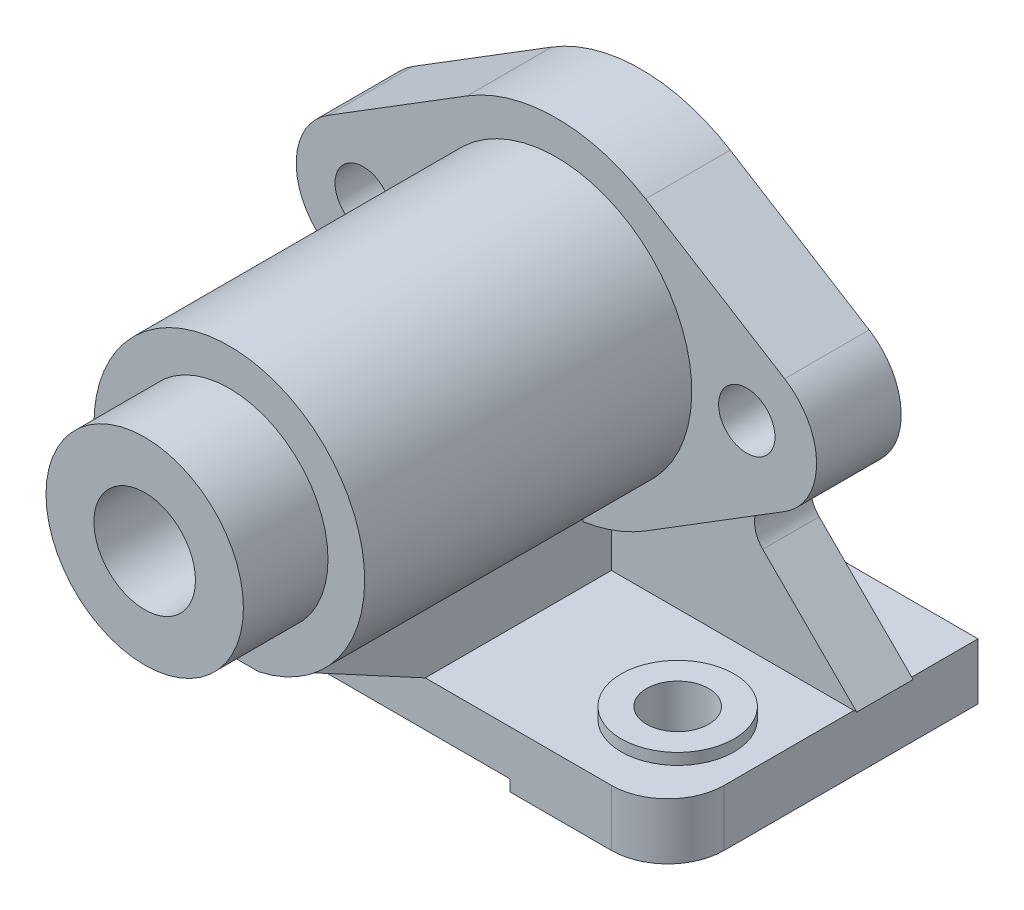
ISO-10303-21;
HEADER;
FILE_DESCRIPTION(('STEP AP214'),'2;1');
FILE_NAME('part.step','',(''),(''),'','','');
FILE_SCHEMA(('AUTOMOTIVE_DESIGN { 1 0 10303 214 1 1 1 1 }'));
ENDSEC;
DATA;
#1=APPLICATION_CONTEXT('core data for automotive mechanical design processes');
#2=APPLICATION_PROTOCOL_DEFINITION('international standard','automotive_design',2000,#1);
#3=PRODUCT_CONTEXT('',#1,'mechanical');
#4=PRODUCT('Part','Part','',(#3));
#5=PRODUCT_RELATED_PRODUCT_CATEGORY('part','',(#4));
#6=PRODUCT_DEFINITION_FORMATION('','',#4);
#7=PRODUCT_DEFINITION_CONTEXT('part definition',#1,'design');
#8=PRODUCT_DEFINITION('design','',#6,#7);
#9=PRODUCT_DEFINITION_SHAPE('','',#8);
#10=(LENGTH_UNIT() NAMED_UNIT(*) SI_UNIT(.MILLI.,.METRE.));
#11=(NAMED_UNIT(*) PLANE_ANGLE_UNIT() SI_UNIT($,.RADIAN.));
#12=(NAMED_UNIT(*) SI_UNIT($,.STERADIAN.) SOLID_ANGLE_UNIT());
#13=UNCERTAINTY_MEASURE_WITH_UNIT(LENGTH_MEASURE(1.E-05),#10,'distance_accuracy_value','');
#14=(GEOMETRIC_REPRESENTATION_CONTEXT(3) GLOBAL_UNCERTAINTY_ASSIGNED_CONTEXT((#13)) GLOBAL_UNIT_ASSIGNED_CONTEXT((#10,
#11,#12)) REPRESENTATION_CONTEXT('',''));
#15=CARTESIAN_POINT('',(0.,0.,0.));
#16=DIRECTION('',(0.,0.,1.));
#17=DIRECTION('',(1.,0.,0.));
#18=AXIS2_PLACEMENT_3D('',#15,#16,#17);
#19=CARTESIAN_POINT('',(-100.076,-38.514,55.));
#20=DIRECTION('',(1.,0.,0.));
#21=DIRECTION('',(0.,1.,0.));
#22=AXIS2_PLACEMENT_3D('',#19,#20,#21);
#23=PLANE('',#22);
#24=DIRECTION('',(0.,1.,0.));
#25=VECTOR('',#24,1.);
#26=CARTESIAN_POINT('',(-100.076,-94.514,45.));
#27=LINE('',#26,#25);
#28=CARTESIAN_POINT('',(-100.076,-48.514,45.));
#29=VERTEX_POINT('',#28);
#30=CARTESIAN_POINT('',(-100.076,-38.514,45.));
#31=VERTEX_POINT('',#30);
#32=EDGE_CURVE('E682',#29,#31,#27,.T.);
#33=ORIENTED_EDGE('',*,*,#32,.T.);
#34=DIRECTION('',(0.,0.,-1.));
#35=VECTOR('',#34,1.);
#36=CARTESIAN_POINT('',(-100.076,-38.514,55.));
#37=LINE('',#36,#35);
#38=CARTESIAN_POINT('',(-100.076,-38.514,22.));
#39=VERTEX_POINT('',#38);
#40=EDGE_CURVE('E289',#31,#39,#37,.T.);
#41=ORIENTED_EDGE('',*,*,#40,.T.);
#42=DIRECTION('',(0.,0.,-1.));
#43=VECTOR('',#42,1.);
#44=CARTESIAN_POINT('',(-100.076,-38.514,22.));
#45=LINE('',#44,#43);
#46=CARTESIAN_POINT('',(-100.076,-38.514,12.));
#47=VERTEX_POINT('',#46);
#48=EDGE_CURVE('E530',#39,#47,#45,.T.);
#49=ORIENTED_EDGE('',*,*,#48,.T.);
#50=DIRECTION('',(0.,0.,-1.));
#51=VECTOR('',#50,1.);
#52=CARTESIAN_POINT('',(-100.076,-38.514,55.));
#53=LINE('',#52,#51);
#54=CARTESIAN_POINT('',(-100.076,-38.514,0.));
#55=VERTEX_POINT('',#54);
#56=EDGE_CURVE('E501',#47,#55,#53,.T.);
#57=ORIENTED_EDGE('',*,*,#56,.T.);
#58=DIRECTION('',(0.,-1.,0.));
#59=VECTOR('',#58,1.);
#60=CARTESIAN_POINT('',(-100.076,-38.514,0.));
#61=LINE('',#60,#59);
#62=CARTESIAN_POINT('',(-100.076,-48.514,0.));
#63=VERTEX_POINT('',#62);
#64=EDGE_CURVE('E576',#55,#63,#61,.T.);
#65=ORIENTED_EDGE('',*,*,#64,.T.);
#66=DIRECTION('',(0.,0.,-1.));
#67=VECTOR('',#66,1.);
#68=CARTESIAN_POINT('',(-100.076,-48.514,55.));
#69=LINE('',#68,#67);
#70=EDGE_CURVE('E307',#29,#63,#69,.T.);
#71=ORIENTED_EDGE('',*,*,#70,.F.);
#72=EDGE_LOOP('',(#33,#41,#49,#57,#65,#71));
#73=FACE_BOUND('',#72,.T.);
#74=ADVANCED_FACE('F37',(#73),#23,.F.);
#75=CARTESIAN_POINT('',(-100.076,-48.5139999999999,55.));
#76=DIRECTION('',(0.,0.,1.));
#77=DIRECTION('',(1.,0.,0.));
#78=AXIS2_PLACEMENT_3D('',#75,#76,#77);
#79=PLANE('',#78);
#80=DIRECTION('',(0.,1.,0.));
#81=VECTOR('',#80,1.);
#82=CARTESIAN_POINT('',(-14.076,-94.514,55.));
#83=LINE('',#82,#81);
#84=CARTESIAN_POINT('',(-14.076,-48.514,55.));
#85=VERTEX_POINT('',#84);
#86=CARTESIAN_POINT('',(-14.076,-38.514,55.));
#87=VERTEX_POINT('',#86);
#88=EDGE_CURVE('E280',#85,#87,#83,.T.);
#89=ORIENTED_EDGE('',*,*,#88,.T.);
#90=DIRECTION('',(-1.,0.,0.));
#91=VECTOR('',#90,1.);
#92=CARTESIAN_POINT('',(-4.076,-38.514,55.));
#93=LINE('',#92,#91);
#94=CARTESIAN_POINT('',(-47.0759999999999,-38.514,55.));
#95=VERTEX_POINT('',#94);
#96=EDGE_CURVE('E279',#87,#95,#93,.T.);
#97=ORIENTED_EDGE('',*,*,#96,.T.);
#98=DIRECTION('',(1.,0.,0.));
#99=VECTOR('',#98,1.);
#100=CARTESIAN_POINT('',(-100.076,-38.514,55.));
#101=LINE('',#100,#99);
#102=CARTESIAN_POINT('',(-57.076,-38.514,55.));
#103=VERTEX_POINT('',#102);
#104=EDGE_CURVE('E369',#103,#95,#101,.T.);
#105=ORIENTED_EDGE('',*,*,#104,.F.);
#106=CARTESIAN_POINT('',(-90.076,-38.514,55.));
#107=VERTEX_POINT('',#106);
#108=EDGE_CURVE('E347',#103,#107,#93,.T.);
#109=ORIENTED_EDGE('',*,*,#108,.T.);
#110=DIRECTION('',(0.,1.,0.));
#111=VECTOR('',#110,1.);
#112=CARTESIAN_POINT('',(-90.076,-94.514,55.));
#113=LINE('',#112,#111);
#114=CARTESIAN_POINT('',(-90.076,-48.514,55.));
#115=VERTEX_POINT('',#114);
#116=EDGE_CURVE('E44',#107,#115,#113,.F.);
#117=ORIENTED_EDGE('',*,*,#116,.T.);
#118=DIRECTION('',(1.,0.,0.));
#119=VECTOR('',#118,1.);
#120=CARTESIAN_POINT('',(-100.076,-48.514,55.));
#121=LINE('',#120,#119);
#122=CARTESIAN_POINT('',(-72.076,-48.514,55.));
#123=VERTEX_POINT('',#122);
#124=EDGE_CURVE('E343',#115,#123,#121,.T.);
#125=ORIENTED_EDGE('',*,*,#124,.T.);
#126=DIRECTION('',(0.,1.,0.));
#127=VECTOR('',#126,1.);
#128=CARTESIAN_POINT('',(-72.076,-46.514,55.));
#129=LINE('',#128,#127);
#130=CARTESIAN_POINT('',(-72.076,-46.514,55.));
#131=VERTEX_POINT('',#130);
#132=EDGE_CURVE('E353',#123,#131,#129,.T.);
#133=ORIENTED_EDGE('',*,*,#132,.T.);
#134=DIRECTION('',(1.,0.,0.));
#135=VECTOR('',#134,1.);
#136=CARTESIAN_POINT('',(-72.076,-46.514,55.));
#137=LINE('',#136,#135);
#138=CARTESIAN_POINT('',(-32.076,-46.514,55.));
#139=VERTEX_POINT('',#138);
#140=EDGE_CURVE('E356',#131,#139,#137,.T.);
#141=ORIENTED_EDGE('',*,*,#140,.T.);
#142=DIRECTION('',(0.,-1.,0.));
#143=VECTOR('',#142,1.);
#144=CARTESIAN_POINT('',(-32.076,-46.514,55.));
#145=LINE('',#144,#143);
#146=CARTESIAN_POINT('',(-32.076,-48.514,55.));
#147=VERTEX_POINT('',#146);
#148=EDGE_CURVE('E364',#139,#147,#145,.T.);
#149=ORIENTED_EDGE('',*,*,#148,.T.);
#150=DIRECTION('',(1.,0.,0.));
#151=VECTOR('',#150,1.);
#152=CARTESIAN_POINT('',(-32.076,-48.514,55.));
#153=LINE('',#152,#151);
#154=EDGE_CURVE('E366',#147,#85,#153,.T.);
#155=ORIENTED_EDGE('',*,*,#154,.T.);
#156=EDGE_LOOP('',(#89,#97,#105,#109,#117,#125,#133,#141,#149,#155));
#157=FACE_BOUND('',#156,.T.);
#158=ADVANCED_FACE('F342',(#157),#79,.T.);
#159=CARTESIAN_POINT('',(-85.958373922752,1.07842841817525,22.));
#160=DIRECTION('',(0.,0.,-1.));
#161=DIRECTION('',(-1.,0.,0.));
#162=AXIS2_PLACEMENT_3D('',#159,#160,#161);
#163=PLANE('',#162);
#164=DIRECTION('',(-1.,0.,0.));
#165=VECTOR('',#164,1.);
#166=CARTESIAN_POINT('',(-3.57715389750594,-38.514,22.));
#167=LINE('',#166,#165);
#168=CARTESIAN_POINT('',(-57.076,-38.514,22.));
#169=VERTEX_POINT('',#168);
#170=EDGE_CURVE('E510',#169,#39,#167,.T.);
#171=ORIENTED_EDGE('',*,*,#170,.F.);
#172=DIRECTION('',(0.,1.,0.));
#173=VECTOR('',#172,1.);
#174=CARTESIAN_POINT('',(-57.076,1.07842841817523,22.));
#175=LINE('',#174,#173);
#176=CARTESIAN_POINT('',(-57.076,-28.4587271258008,22.));
#177=VERTEX_POINT('',#176);
#178=EDGE_CURVE('E414',#169,#177,#175,.T.);
#179=ORIENTED_EDGE('',*,*,#178,.T.);
#180=CARTESIAN_POINT('',(-51.826576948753,1.07842841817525,22.));
#181=DIRECTION('',(0.,0.,1.));
#182=DIRECTION('',(-1.,0.,0.));
#183=AXIS2_PLACEMENT_3D('',#180,#181,#182);
#184=CIRCLE('',#183,30.);
#185=CARTESIAN_POINT('',(-67.6476015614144,-24.4106904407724,22.));
#186=VERTEX_POINT('',#185);
#187=EDGE_CURVE('E437',#186,#177,#184,.T.);
#188=ORIENTED_EDGE('',*,*,#187,.F.);
#189=DIRECTION('',(0.849637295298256,-0.527367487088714,0.));
#190=VECTOR('',#189,1.);
#191=CARTESIAN_POINT('',(-92.2867837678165,-9.11721912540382,22.));
#192=LINE('',#191,#190);
#193=CARTESIAN_POINT('',(-84.3116770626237,-14.0673454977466,22.));
#194=VERTEX_POINT('',#193);
#195=EDGE_CURVE('E317',#194,#186,#192,.T.);
#196=ORIENTED_EDGE('',*,*,#195,.F.);
#197=CARTESIAN_POINT('',(-86.9484885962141,-18.3154902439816,22.));
#198=DIRECTION('',(0.,0.,1.));
#199=DIRECTION('',(-1.,0.,0.));
#200=AXIS2_PLACEMENT_3D('',#197,#198,#199);
#201=CIRCLE('',#200,4.99995088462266);
#202=CARTESIAN_POINT('',(-83.4129894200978,-21.850989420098,22.));
#203=VERTEX_POINT('',#202);
#204=EDGE_CURVE('E517',#203,#194,#201,.T.);
#205=ORIENTED_EDGE('',*,*,#204,.F.);
#206=DIRECTION('',(0.707106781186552,0.707106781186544,0.));
#207=VECTOR('',#206,1.);
#208=CARTESIAN_POINT('',(-100.076,-38.514,22.));
#209=LINE('',#208,#207);
#210=EDGE_CURVE('E514',#39,#203,#209,.T.);
#211=ORIENTED_EDGE('',*,*,#210,.F.);
#212=EDGE_LOOP('',(#171,#179,#188,#196,#205,#211));
#213=FACE_BOUND('',#212,.T.);
#214=ADVANCED_FACE('F679',(#213),#163,.F.);
#215=CARTESIAN_POINT('',(-4.076,-38.514,55.));
#216=DIRECTION('',(0.,-1.,0.));
#217=DIRECTION('',(1.,0.,0.));
#218=AXIS2_PLACEMENT_3D('',#215,#216,#217);
#219=PLANE('',#218);
#220=CARTESIAN_POINT('',(-86.3305454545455,-38.514,39.));
#221=DIRECTION('',(0.,-1.,0.));
#222=DIRECTION('',(1.,0.,0.));
#223=AXIS2_PLACEMENT_3D('',#220,#221,#222);
#224=CIRCLE('',#223,9.99999999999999);
#225=CARTESIAN_POINT('',(-76.3305454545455,-38.514,39.));
#226=VERTEX_POINT('',#225);
#227=EDGE_CURVE('E312',#226,#226,#224,.F.);
#228=ORIENTED_EDGE('',*,*,#227,.F.);
#229=EDGE_LOOP('',(#228));
#230=FACE_BOUND('',#229,.T.);
#231=ORIENTED_EDGE('',*,*,#40,.F.);
#232=CARTESIAN_POINT('',(-90.076,-38.514,45.));
#233=DIRECTION('',(0.,-1.,0.));
#234=DIRECTION('',(-1.,0.,0.));
#235=AXIS2_PLACEMENT_3D('',#232,#233,#234);
#236=CIRCLE('',#235,9.99999999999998);
#237=EDGE_CURVE('E685',#107,#31,#236,.T.);
#238=ORIENTED_EDGE('',*,*,#237,.F.);
#239=ORIENTED_EDGE('',*,*,#108,.F.);
#240=DIRECTION('',(0.,0.,1.));
#241=VECTOR('',#240,1.);
#242=CARTESIAN_POINT('',(-57.076,-38.514,-19.015360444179));
#243=LINE('',#242,#241);
#244=EDGE_CURVE('E648',#169,#103,#243,.T.);
#245=ORIENTED_EDGE('',*,*,#244,.F.);
#246=ORIENTED_EDGE('',*,*,#170,.T.);
#247=EDGE_LOOP('',(#231,#238,#239,#245,#246));
#248=FACE_BOUND('',#247,.T.);
#249=ADVANCED_FACE('F688',(#230,#248),#219,.F.);
#250=CARTESIAN_POINT('',(-115.,-38.514,-1.42378444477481));
#251=DIRECTION('',(0.,-1.,0.));
#252=DIRECTION('',(0.,0.,-1.));
#253=AXIS2_PLACEMENT_3D('',#250,#251,#252);
#254=PLANE('',#253);
#255=DIRECTION('',(1.,0.,0.));
#256=VECTOR('',#255,1.);
#257=CARTESIAN_POINT('',(-115.,-38.514,12.));
#258=LINE('',#257,#256);
#259=CARTESIAN_POINT('',(-57.076,-38.514,12.));
#260=VERTEX_POINT('',#259);
#261=EDGE_CURVE('E476',#47,#260,#258,.T.);
#262=ORIENTED_EDGE('',*,*,#261,.T.);
#263=CARTESIAN_POINT('',(-57.076,-38.514,0.));
#264=VERTEX_POINT('',#263);
#265=EDGE_CURVE('E404',#264,#260,#243,.T.);
#266=ORIENTED_EDGE('',*,*,#265,.F.);
#267=DIRECTION('',(1.,0.,0.));
#268=VECTOR('',#267,1.);
#269=CARTESIAN_POINT('',(-100.076,-38.514,0.));
#270=LINE('',#269,#268);
#271=EDGE_CURVE('E498',#55,#264,#270,.T.);
#272=ORIENTED_EDGE('',*,*,#271,.F.);
#273=ORIENTED_EDGE('',*,*,#56,.F.);
#274=EDGE_LOOP('',(#262,#266,#272,#273));
#275=FACE_BOUND('',#274,.T.);
#276=ADVANCED_FACE('F803',(#275),#254,.F.);
#277=CARTESIAN_POINT('',(-51.826576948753,1.07842841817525,27.));
#278=DIRECTION('',(0.,0.,-1.));
#279=DIRECTION('',(-1.,0.,0.));
#280=AXIS2_PLACEMENT_3D('',#277,#278,#279);
#281=CYLINDRICAL_SURFACE('',#280,30.);
#282=ORIENTED_EDGE('',*,*,#187,.T.);
#283=DIRECTION('',(0.,0.,-1.));
#284=VECTOR('',#283,1.);
#285=CARTESIAN_POINT('',(-57.076,-28.4587271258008,27.));
#286=LINE('',#285,#284);
#287=CARTESIAN_POINT('',(-57.076,-28.4587271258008,27.));
#288=VERTEX_POINT('',#287);
#289=EDGE_CURVE('E411',#177,#288,#286,.F.);
#290=ORIENTED_EDGE('',*,*,#289,.T.);
#291=CARTESIAN_POINT('',(-51.826576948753,1.07842841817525,27.));
#292=DIRECTION('',(0.,0.,1.));
#293=DIRECTION('',(-1.,0.,0.));
#294=AXIS2_PLACEMENT_3D('',#291,#292,#293);
#295=CIRCLE('',#294,30.);
#296=CARTESIAN_POINT('',(-67.6476015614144,-24.4106904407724,27.));
#297=VERTEX_POINT('',#296);
#298=EDGE_CURVE('E460',#297,#288,#295,.T.);
#299=ORIENTED_EDGE('',*,*,#298,.F.);
#300=DIRECTION('',(0.,0.,-1.));
#301=VECTOR('',#300,1.);
#302=CARTESIAN_POINT('',(-67.6476015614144,-24.4106904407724,27.));
#303=LINE('',#302,#301);
#304=EDGE_CURVE('E469',#297,#186,#303,.T.);
#305=ORIENTED_EDGE('',*,*,#304,.T.);
#306=EDGE_LOOP('',(#282,#290,#299,#305));
#307=FACE_BOUND('',#306,.T.);
#308=ADVANCED_FACE('F672',(#307),#281,.T.);
#309=CARTESIAN_POINT('',(-51.826576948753,1.07842841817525,85.));
#310=DIRECTION('',(0.,0.,1.));
#311=DIRECTION('',(1.,0.,0.));
#312=AXIS2_PLACEMENT_3D('',#309,#310,#311);
#313=PLANE('',#312);
#314=DIRECTION('',(-1.,0.,0.));
#315=VECTOR('',#314,1.);
#316=CARTESIAN_POINT('',(5.92400000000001,-22.3404434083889,85.));
#317=LINE('',#316,#315);
#318=CARTESIAN_POINT('',(-46.5771538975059,-22.3404434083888,85.));
#319=VERTEX_POINT('',#318);
#320=CARTESIAN_POINT('',(-57.076,-22.3404434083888,85.));
#321=VERTEX_POINT('',#320);
#322=EDGE_CURVE('E388',#319,#321,#317,.T.);
#323=ORIENTED_EDGE('',*,*,#322,.F.);
#324=CARTESIAN_POINT('',(-51.826576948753,1.07842841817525,85.));
#325=DIRECTION('',(0.,0.,1.));
#326=DIRECTION('',(1.,0.,0.));
#327=AXIS2_PLACEMENT_3D('',#324,#325,#326);
#328=CIRCLE('',#327,24.);
#329=EDGE_CURVE('E429',#319,#321,#328,.T.);
#330=ORIENTED_EDGE('',*,*,#329,.T.);
#331=EDGE_LOOP('',(#323,#330));
#332=FACE_BOUND('',#331,.T.);
#333=CARTESIAN_POINT('',(-51.826576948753,1.07842841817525,85.));
#334=DIRECTION('',(0.,0.,1.));
#335=DIRECTION('',(1.,0.,0.));
#336=AXIS2_PLACEMENT_3D('',#333,#334,#335);
#337=CIRCLE('',#336,17.5);
#338=CARTESIAN_POINT('',(-34.3265769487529,1.07842841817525,85.));
#339=VERTEX_POINT('',#338);
#340=EDGE_CURVE('E378',#339,#339,#337,.T.);
#341=ORIENTED_EDGE('',*,*,#340,.F.);
#342=EDGE_LOOP('',(#341));
#343=FACE_BOUND('',#342,.T.);
#344=ADVANCED_FACE('F641',(#332,#343),#313,.T.);
#345=CARTESIAN_POINT('',(-17.694779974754,1.07842841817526,27.));
#346=DIRECTION('',(0.,0.,1.));
#347=DIRECTION('',(1.,0.,0.));
#348=AXIS2_PLACEMENT_3D('',#345,#346,#347);
#349=PLANE('',#348);
#350=CARTESIAN_POINT('',(-86.076,1.48600000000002,27.));
#351=DIRECTION('',(0.,0.,1.));
#352=DIRECTION('',(1.,0.,0.));
#353=AXIS2_PLACEMENT_3D('',#350,#351,#352);
#354=CIRCLE('',#353,5.);
#355=CARTESIAN_POINT('',(-81.076,1.48600000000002,27.));
#356=VERTEX_POINT('',#355);
#357=EDGE_CURVE('E1409',#356,#356,#354,.T.);
#358=ORIENTED_EDGE('',*,*,#357,.F.);
#359=EDGE_LOOP('',(#358));
#360=FACE_BOUND('',#359,.T.);
#361=CARTESIAN_POINT('',(-18.076,1.48600000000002,27.));
#362=DIRECTION('',(0.,0.,1.));
#363=DIRECTION('',(1.,0.,0.));
#364=AXIS2_PLACEMENT_3D('',#361,#362,#363);
#365=CIRCLE('',#364,5.);
#366=CARTESIAN_POINT('',(-13.076,1.48600000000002,27.));
#367=VERTEX_POINT('',#366);
#368=EDGE_CURVE('E281',#367,#367,#365,.T.);
#369=ORIENTED_EDGE('',*,*,#368,.F.);
#370=EDGE_LOOP('',(#369));
#371=FACE_BOUND('',#370,.T.);
#372=DIRECTION('',(0.,-1.,0.));
#373=VECTOR('',#372,1.);
#374=CARTESIAN_POINT('',(-57.076,1.07842841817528,27.));
#375=LINE('',#374,#373);
#376=CARTESIAN_POINT('',(-57.076,-22.3404434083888,27.));
#377=VERTEX_POINT('',#376);
#378=EDGE_CURVE('E417',#377,#288,#375,.T.);
#379=ORIENTED_EDGE('',*,*,#378,.F.);
#380=CARTESIAN_POINT('',(-51.826576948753,1.07842841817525,27.));
#381=DIRECTION('',(0.,0.,1.));
#382=DIRECTION('',(1.,0.,0.));
#383=AXIS2_PLACEMENT_3D('',#380,#381,#382);
#384=CIRCLE('',#383,24.);
#385=CARTESIAN_POINT('',(-47.076,-22.4467074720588,27.));
#386=VERTEX_POINT('',#385);
#387=EDGE_CURVE('E426',#386,#377,#384,.T.);
#388=ORIENTED_EDGE('',*,*,#387,.F.);
#389=DIRECTION('',(0.,1.,0.));
#390=VECTOR('',#389,1.);
#391=CARTESIAN_POINT('',(-47.076,1.07842841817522,27.));
#392=LINE('',#391,#390);
#393=CARTESIAN_POINT('',(-47.076,-28.5430505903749,27.));
#394=VERTEX_POINT('',#393);
#395=EDGE_CURVE('E406',#394,#386,#392,.T.);
#396=ORIENTED_EDGE('',*,*,#395,.F.);
#397=CARTESIAN_POINT('',(-36.0055523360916,-24.4106904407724,27.));
#398=VERTEX_POINT('',#397);
#399=EDGE_CURVE('E459',#394,#398,#295,.T.);
#400=ORIENTED_EDGE('',*,*,#399,.T.);
#401=DIRECTION('',(0.849637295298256,0.527367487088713,0.));
#402=VECTOR('',#401,1.);
#403=CARTESIAN_POINT('',(-11.3663701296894,-9.11721912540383,27.));
#404=LINE('',#403,#402);
#405=CARTESIAN_POINT('',(-11.3663701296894,-9.11721912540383,27.));
#406=VERTEX_POINT('',#405);
#407=EDGE_CURVE('E463',#398,#406,#404,.T.);
#408=ORIENTED_EDGE('',*,*,#407,.T.);
#409=CARTESIAN_POINT('',(-17.694779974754,1.07842841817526,27.));
#410=DIRECTION('',(0.,0.,1.));
#411=DIRECTION('',(1.,0.,0.));
#412=AXIS2_PLACEMENT_3D('',#409,#410,#411);
#413=CIRCLE('',#412,12.);
#414=CARTESIAN_POINT('',(-11.3663701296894,11.2740759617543,27.));
#415=VERTEX_POINT('',#414);
#416=EDGE_CURVE('E442',#406,#415,#413,.T.);
#417=ORIENTED_EDGE('',*,*,#416,.T.);
#418=DIRECTION('',(-0.849637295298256,0.527367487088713,0.));
#419=VECTOR('',#418,1.);
#420=CARTESIAN_POINT('',(-11.3663701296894,11.2740759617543,27.));
#421=LINE('',#420,#419);
#422=CARTESIAN_POINT('',(-36.0055523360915,26.5675472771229,27.));
#423=VERTEX_POINT('',#422);
#424=EDGE_CURVE('E445',#415,#423,#421,.T.);
#425=ORIENTED_EDGE('',*,*,#424,.T.);
#426=CARTESIAN_POINT('',(-51.826576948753,1.07842841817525,27.));
#427=DIRECTION('',(0.,0.,1.));
#428=DIRECTION('',(1.,0.,0.));
#429=AXIS2_PLACEMENT_3D('',#426,#427,#428);
#430=CIRCLE('',#429,30.);
#431=CARTESIAN_POINT('',(-67.6476015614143,26.5675472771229,27.));
#432=VERTEX_POINT('',#431);
#433=EDGE_CURVE('E448',#423,#432,#430,.T.);
#434=ORIENTED_EDGE('',*,*,#433,.T.);
#435=DIRECTION('',(-0.849637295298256,-0.527367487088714,0.));
#436=VECTOR('',#435,1.);
#437=CARTESIAN_POINT('',(-92.2867837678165,11.2740759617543,27.));
#438=LINE('',#437,#436);
#439=CARTESIAN_POINT('',(-92.2867837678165,11.2740759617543,27.));
#440=VERTEX_POINT('',#439);
#441=EDGE_CURVE('E451',#432,#440,#438,.T.);
#442=ORIENTED_EDGE('',*,*,#441,.T.);
#443=CARTESIAN_POINT('',(-85.958373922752,1.07842841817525,27.));
#444=DIRECTION('',(0.,0.,1.));
#445=DIRECTION('',(1.,0.,0.));
#446=AXIS2_PLACEMENT_3D('',#443,#444,#445);
#447=CIRCLE('',#446,12.);
#448=CARTESIAN_POINT('',(-92.2867837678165,-9.11721912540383,27.));
#449=VERTEX_POINT('',#448);
#450=EDGE_CURVE('E454',#440,#449,#447,.T.);
#451=ORIENTED_EDGE('',*,*,#450,.T.);
#452=DIRECTION('',(0.849637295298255,-0.527367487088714,0.));
#453=VECTOR('',#452,1.);
#454=CARTESIAN_POINT('',(-92.2867837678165,-9.11721912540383,27.));
#455=LINE('',#454,#453);
#456=EDGE_CURVE('E457',#449,#297,#455,.T.);
#457=ORIENTED_EDGE('',*,*,#456,.T.);
#458=ORIENTED_EDGE('',*,*,#298,.T.);
#459=EDGE_LOOP('',(#379,#388,#396,#400,#408,#417,#425,#434,#442,#451,#457,#458));
#460=FACE_BOUND('',#459,.T.);
#461=ADVANCED_FACE('F635',(#360,#371,#460),#349,.T.);
#462=CARTESIAN_POINT('',(-115.,30.8970163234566,12.));
#463=DIRECTION('',(0.,0.,1.));
#464=DIRECTION('',(1.,0.,0.));
#465=AXIS2_PLACEMENT_3D('',#462,#463,#464);
#466=PLANE('',#465);
#467=CARTESIAN_POINT('',(-86.076,1.48600000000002,12.));
#468=DIRECTION('',(0.,0.,-1.));
#469=DIRECTION('',(-1.,0.,0.));
#470=AXIS2_PLACEMENT_3D('',#467,#468,#469);
#471=CIRCLE('',#470,5.);
#472=CARTESIAN_POINT('',(-91.076,1.48600000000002,12.));
#473=VERTEX_POINT('',#472);
#474=EDGE_CURVE('E1411',#473,#473,#471,.T.);
#475=ORIENTED_EDGE('',*,*,#474,.F.);
#476=EDGE_LOOP('',(#475));
#477=FACE_BOUND('',#476,.T.);
#478=CARTESIAN_POINT('',(-18.076,1.48600000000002,12.));
#479=DIRECTION('',(0.,0.,-1.));
#480=DIRECTION('',(1.,0.,0.));
#481=AXIS2_PLACEMENT_3D('',#478,#479,#480);
#482=CIRCLE('',#481,5.);
#483=CARTESIAN_POINT('',(-13.076,1.48600000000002,12.));
#484=VERTEX_POINT('',#483);
#485=EDGE_CURVE('E1413',#484,#484,#482,.T.);
#486=ORIENTED_EDGE('',*,*,#485,.F.);
#487=EDGE_LOOP('',(#486));
#488=FACE_BOUND('',#487,.T.);
#489=CARTESIAN_POINT('',(-51.826576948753,1.07842841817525,12.));
#490=DIRECTION('',(0.,0.,1.));
#491=DIRECTION('',(1.,0.,0.));
#492=AXIS2_PLACEMENT_3D('',#489,#490,#491);
#493=CIRCLE('',#492,24.);
#494=CARTESIAN_POINT('',(-57.076,-22.3404434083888,12.));
#495=VERTEX_POINT('',#494);
#496=CARTESIAN_POINT('',(-47.076,-22.4467074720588,12.));
#497=VERTEX_POINT('',#496);
#498=EDGE_CURVE('E319',#495,#497,#493,.F.);
#499=ORIENTED_EDGE('',*,*,#498,.F.);
#500=DIRECTION('',(0.,-1.,0.));
#501=VECTOR('',#500,1.);
#502=CARTESIAN_POINT('',(-57.076,30.8970163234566,12.));
#503=LINE('',#502,#501);
#504=EDGE_CURVE('E379',#495,#260,#503,.T.);
#505=ORIENTED_EDGE('',*,*,#504,.T.);
#506=ORIENTED_EDGE('',*,*,#261,.F.);
#507=DIRECTION('',(0.707106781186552,0.707106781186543,0.));
#508=VECTOR('',#507,1.);
#509=CARTESIAN_POINT('',(-100.076,-38.514,12.));
#510=LINE('',#509,#508);
#511=CARTESIAN_POINT('',(-83.4129894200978,-21.850989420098,12.));
#512=VERTEX_POINT('',#511);
#513=EDGE_CURVE('E495',#47,#512,#510,.T.);
#514=ORIENTED_EDGE('',*,*,#513,.T.);
#515=CARTESIAN_POINT('',(-86.9484885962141,-18.3154902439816,12.));
#516=DIRECTION('',(0.,0.,1.));
#517=DIRECTION('',(1.,0.,0.));
#518=AXIS2_PLACEMENT_3D('',#515,#516,#517);
#519=CIRCLE('',#518,4.99995088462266);
#520=CARTESIAN_POINT('',(-84.3116770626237,-14.0673454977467,12.));
#521=VERTEX_POINT('',#520);
#522=EDGE_CURVE('E493',#512,#521,#519,.T.);
#523=ORIENTED_EDGE('',*,*,#522,.T.);
#524=DIRECTION('',(-0.849637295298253,0.527367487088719,0.));
#525=VECTOR('',#524,1.);
#526=CARTESIAN_POINT('',(-92.2867837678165,-9.11721912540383,12.));
#527=LINE('',#526,#525);
#528=CARTESIAN_POINT('',(-92.2867837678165,-9.11721912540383,12.));
#529=VERTEX_POINT('',#528);
#530=EDGE_CURVE('E491',#521,#529,#527,.T.);
#531=ORIENTED_EDGE('',*,*,#530,.T.);
#532=CARTESIAN_POINT('',(-85.958373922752,1.07842841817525,12.));
#533=DIRECTION('',(0.,0.,1.));
#534=DIRECTION('',(1.,0.,0.));
#535=AXIS2_PLACEMENT_3D('',#532,#533,#534);
#536=CIRCLE('',#535,12.);
#537=CARTESIAN_POINT('',(-92.2867837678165,11.2740759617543,12.));
#538=VERTEX_POINT('',#537);
#539=EDGE_CURVE('E489',#529,#538,#536,.F.);
#540=ORIENTED_EDGE('',*,*,#539,.T.);
#541=DIRECTION('',(0.849637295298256,0.527367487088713,0.));
#542=VECTOR('',#541,1.);
#543=CARTESIAN_POINT('',(-92.2867837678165,11.2740759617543,12.));
#544=LINE('',#543,#542);
#545=CARTESIAN_POINT('',(-67.6476015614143,26.5675472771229,12.));
#546=VERTEX_POINT('',#545);
#547=EDGE_CURVE('E315',#538,#546,#544,.T.);
#548=ORIENTED_EDGE('',*,*,#547,.T.);
#549=CARTESIAN_POINT('',(-51.826576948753,1.07842841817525,12.));
#550=DIRECTION('',(0.,0.,1.));
#551=DIRECTION('',(1.,0.,0.));
#552=AXIS2_PLACEMENT_3D('',#549,#550,#551);
#553=CIRCLE('',#552,30.);
#554=CARTESIAN_POINT('',(-36.0055523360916,26.5675472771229,12.));
#555=VERTEX_POINT('',#554);
#556=EDGE_CURVE('E477',#546,#555,#553,.F.);
#557=ORIENTED_EDGE('',*,*,#556,.T.);
#558=DIRECTION('',(0.849637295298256,-0.527367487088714,0.));
#559=VECTOR('',#558,1.);
#560=CARTESIAN_POINT('',(-11.3663701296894,11.2740759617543,12.));
#561=LINE('',#560,#559);
#562=CARTESIAN_POINT('',(-11.3663701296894,11.2740759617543,12.));
#563=VERTEX_POINT('',#562);
#564=EDGE_CURVE('E479',#555,#563,#561,.T.);
#565=ORIENTED_EDGE('',*,*,#564,.T.);
#566=CARTESIAN_POINT('',(-17.694779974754,1.07842841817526,12.));
#567=DIRECTION('',(0.,0.,1.));
#568=DIRECTION('',(1.,0.,0.));
#569=AXIS2_PLACEMENT_3D('',#566,#567,#568);
#570=CIRCLE('',#569,12.);
#571=CARTESIAN_POINT('',(-11.3663701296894,-9.11721912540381,12.));
#572=VERTEX_POINT('',#571);
#573=EDGE_CURVE('E481',#563,#572,#570,.F.);
#574=ORIENTED_EDGE('',*,*,#573,.T.);
#575=DIRECTION('',(-0.849637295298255,-0.527367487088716,0.));
#576=VECTOR('',#575,1.);
#577=CARTESIAN_POINT('',(-11.3663701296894,-9.11721912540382,12.));
#578=LINE('',#577,#576);
#579=CARTESIAN_POINT('',(-19.3414768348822,-14.0673454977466,12.));
#580=VERTEX_POINT('',#579);
#581=EDGE_CURVE('E483',#572,#580,#578,.T.);
#582=ORIENTED_EDGE('',*,*,#581,.T.);
#583=CARTESIAN_POINT('',(-16.7046653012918,-18.3154902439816,12.));
#584=DIRECTION('',(0.,0.,1.));
#585=DIRECTION('',(1.,0.,0.));
#586=AXIS2_PLACEMENT_3D('',#583,#584,#585);
#587=CIRCLE('',#586,4.99995088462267);
#588=CARTESIAN_POINT('',(-20.2401644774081,-21.8509894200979,12.));
#589=VERTEX_POINT('',#588);
#590=EDGE_CURVE('E485',#580,#589,#587,.T.);
#591=ORIENTED_EDGE('',*,*,#590,.T.);
#592=DIRECTION('',(0.707106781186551,-0.707106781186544,0.));
#593=VECTOR('',#592,1.);
#594=CARTESIAN_POINT('',(-3.57715389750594,-38.514,12.));
#595=LINE('',#594,#593);
#596=CARTESIAN_POINT('',(-3.57715389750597,-38.514,12.));
#597=VERTEX_POINT('',#596);
#598=EDGE_CURVE('E487',#589,#597,#595,.T.);
#599=ORIENTED_EDGE('',*,*,#598,.T.);
#600=CARTESIAN_POINT('',(-4.076,-38.514,12.));
#601=VERTEX_POINT('',#600);
#602=EDGE_CURVE('E472',#601,#597,#258,.T.);
#603=ORIENTED_EDGE('',*,*,#602,.F.);
#604=CARTESIAN_POINT('',(-47.0759999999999,-38.514,12.));
#605=VERTEX_POINT('',#604);
#606=EDGE_CURVE('E475',#605,#601,#258,.T.);
#607=ORIENTED_EDGE('',*,*,#606,.F.);
#608=DIRECTION('',(0.,1.,0.));
#609=VECTOR('',#608,1.);
#610=CARTESIAN_POINT('',(-47.076,30.8970163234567,12.));
#611=LINE('',#610,#609);
#612=EDGE_CURVE('E408',#605,#497,#611,.T.);
#613=ORIENTED_EDGE('',*,*,#612,.T.);
#614=EDGE_LOOP('',(#499,#505,#506,#514,#523,#531,#540,#548,#557,#565,#574,#582,#591,#599,#603,
#607,#613));
#615=FACE_BOUND('',#614,.T.);
#616=ADVANCED_FACE('F606',(#477,#488,#615),#466,.F.);
#617=CARTESIAN_POINT('',(-47.076,-28.5430505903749,22.));
#618=VERTEX_POINT('',#617);
#619=CARTESIAN_POINT('',(-36.0055523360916,-24.4106904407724,22.));
#620=VERTEX_POINT('',#619);
#621=EDGE_CURVE('E436',#618,#620,#184,.T.);
#622=ORIENTED_EDGE('',*,*,#621,.F.);
#623=DIRECTION('',(0.,-1.,0.));
#624=VECTOR('',#623,1.);
#625=CARTESIAN_POINT('',(-47.076,1.0784284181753,22.));
#626=LINE('',#625,#624);
#627=CARTESIAN_POINT('',(-47.0759999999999,-38.514,22.));
#628=VERTEX_POINT('',#627);
#629=EDGE_CURVE('E403',#618,#628,#626,.T.);
#630=ORIENTED_EDGE('',*,*,#629,.T.);
#631=CARTESIAN_POINT('',(-4.076,-38.514,22.));
#632=VERTEX_POINT('',#631);
#633=EDGE_CURVE('E390',#632,#628,#167,.T.);
#634=ORIENTED_EDGE('',*,*,#633,.F.);
#635=CARTESIAN_POINT('',(-3.57715389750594,-38.514,22.));
#636=VERTEX_POINT('',#635);
#637=EDGE_CURVE('E511',#636,#632,#167,.T.);
#638=ORIENTED_EDGE('',*,*,#637,.F.);
#639=DIRECTION('',(0.707106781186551,-0.707106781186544,0.));
#640=VECTOR('',#639,1.);
#641=CARTESIAN_POINT('',(-3.57715389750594,-38.514,22.));
#642=LINE('',#641,#640);
#643=CARTESIAN_POINT('',(-20.2401644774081,-21.8509894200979,22.));
#644=VERTEX_POINT('',#643);
#645=EDGE_CURVE('E507',#644,#636,#642,.T.);
#646=ORIENTED_EDGE('',*,*,#645,.F.);
#647=CARTESIAN_POINT('',(-16.7046653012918,-18.3154902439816,22.));
#648=DIRECTION('',(0.,0.,1.));
#649=DIRECTION('',(1.,0.,0.));
#650=AXIS2_PLACEMENT_3D('',#647,#648,#649);
#651=CIRCLE('',#650,4.99995088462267);
#652=CARTESIAN_POINT('',(-19.3414768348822,-14.0673454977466,22.));
#653=VERTEX_POINT('',#652);
#654=EDGE_CURVE('E504',#653,#644,#651,.T.);
#655=ORIENTED_EDGE('',*,*,#654,.F.);
#656=DIRECTION('',(0.849637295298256,0.527367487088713,0.));
#657=VECTOR('',#656,1.);
#658=CARTESIAN_POINT('',(-11.3663701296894,-9.11721912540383,22.));
#659=LINE('',#658,#657);
#660=EDGE_CURVE('E440',#620,#653,#659,.T.);
#661=ORIENTED_EDGE('',*,*,#660,.F.);
#662=EDGE_LOOP('',(#622,#630,#634,#638,#646,#655,#661));
#663=FACE_BOUND('',#662,.T.);
#664=ADVANCED_FACE('F614',(#663),#163,.F.);
#665=CARTESIAN_POINT('',(-18.3305454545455,-38.514,39.));
#666=DIRECTION('',(0.,-1.,0.));
#667=DIRECTION('',(1.,0.,0.));
#668=AXIS2_PLACEMENT_3D('',#665,#666,#667);
#669=CIRCLE('',#668,10.);
#670=CARTESIAN_POINT('',(-8.33054545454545,-38.514,39.));
#671=VERTEX_POINT('',#670);
#672=EDGE_CURVE('E309',#671,#671,#669,.F.);
#673=ORIENTED_EDGE('',*,*,#672,.F.);
#674=EDGE_LOOP('',(#673));
#675=FACE_BOUND('',#674,.T.);
#676=ORIENTED_EDGE('',*,*,#96,.F.);
#677=CARTESIAN_POINT('',(-14.076,-38.514,45.));
#678=DIRECTION('',(0.,-1.,0.));
#679=DIRECTION('',(-1.,0.,0.));
#680=AXIS2_PLACEMENT_3D('',#677,#678,#679);
#681=CIRCLE('',#680,9.99999999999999);
#682=CARTESIAN_POINT('',(-4.076,-38.514,45.));
#683=VERTEX_POINT('',#682);
#684=EDGE_CURVE('E267',#683,#87,#681,.T.);
#685=ORIENTED_EDGE('',*,*,#684,.F.);
#686=DIRECTION('',(0.,0.,-1.));
#687=VECTOR('',#686,1.);
#688=CARTESIAN_POINT('',(-4.076,-38.514,55.));
#689=LINE('',#688,#687);
#690=EDGE_CURVE('E276',#683,#632,#689,.T.);
#691=ORIENTED_EDGE('',*,*,#690,.T.);
#692=ORIENTED_EDGE('',*,*,#633,.T.);
#693=DIRECTION('',(0.,0.,1.));
#694=VECTOR('',#693,1.);
#695=CARTESIAN_POINT('',(-47.0759999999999,-38.514,-19.015360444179));
#696=LINE('',#695,#694);
#697=EDGE_CURVE('E384',#628,#95,#696,.T.);
#698=ORIENTED_EDGE('',*,*,#697,.T.);
#699=EDGE_LOOP('',(#676,#685,#691,#692,#698));
#700=FACE_BOUND('',#699,.T.);
#701=ADVANCED_FACE('F274',(#675,#700),#219,.F.);
#702=CARTESIAN_POINT('',(-100.076,-48.514,55.));
#703=DIRECTION('',(0.,1.,0.));
#704=DIRECTION('',(-1.,0.,0.));
#705=AXIS2_PLACEMENT_3D('',#702,#703,#704);
#706=PLANE('',#705);
#707=CARTESIAN_POINT('',(-86.3305454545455,-48.514,39.));
#708=DIRECTION('',(0.,1.,0.));
#709=DIRECTION('',(-1.,0.,0.));
#710=AXIS2_PLACEMENT_3D('',#707,#708,#709);
#711=CIRCLE('',#710,5.5);
#712=CARTESIAN_POINT('',(-91.8305454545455,-48.514,39.));
#713=VERTEX_POINT('',#712);
#714=EDGE_CURVE('E561',#713,#713,#711,.T.);
#715=ORIENTED_EDGE('',*,*,#714,.T.);
#716=EDGE_LOOP('',(#715));
#717=FACE_BOUND('',#716,.T.);
#718=ORIENTED_EDGE('',*,*,#124,.F.);
#719=CARTESIAN_POINT('',(-90.076,-48.514,45.));
#720=DIRECTION('',(0.,1.,0.));
#721=DIRECTION('',(-1.,0.,0.));
#722=AXIS2_PLACEMENT_3D('',#719,#720,#721);
#723=CIRCLE('',#722,9.99999999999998);
#724=EDGE_CURVE('E58',#115,#29,#723,.F.);
#725=ORIENTED_EDGE('',*,*,#724,.T.);
#726=ORIENTED_EDGE('',*,*,#70,.T.);
#727=DIRECTION('',(1.,0.,0.));
#728=VECTOR('',#727,1.);
#729=CARTESIAN_POINT('',(-100.076,-48.514,0.));
#730=LINE('',#729,#728);
#731=CARTESIAN_POINT('',(-72.076,-48.514,0.));
#732=VERTEX_POINT('',#731);
#733=EDGE_CURVE('E579',#63,#732,#730,.T.);
#734=ORIENTED_EDGE('',*,*,#733,.T.);
#735=DIRECTION('',(0.,0.,-1.));
#736=VECTOR('',#735,1.);
#737=CARTESIAN_POINT('',(-72.076,-48.514,55.));
#738=LINE('',#737,#736);
#739=EDGE_CURVE('E304',#123,#732,#738,.T.);
#740=ORIENTED_EDGE('',*,*,#739,.F.);
#741=EDGE_LOOP('',(#718,#725,#726,#734,#740));
#742=FACE_BOUND('',#741,.T.);
#743=ADVANCED_FACE('F350',(#717,#742),#706,.F.);
#744=CARTESIAN_POINT('',(-72.076,-46.514,55.));
#745=DIRECTION('',(-1.,0.,0.));
#746=DIRECTION('',(0.,-1.,0.));
#747=AXIS2_PLACEMENT_3D('',#744,#745,#746);
#748=PLANE('',#747);
#749=DIRECTION('',(0.,1.,0.));
#750=VECTOR('',#749,1.);
#751=CARTESIAN_POINT('',(-72.076,-46.514,0.));
#752=LINE('',#751,#750);
#753=CARTESIAN_POINT('',(-72.076,-46.514,0.));
#754=VERTEX_POINT('',#753);
#755=EDGE_CURVE('E581',#732,#754,#752,.T.);
#756=ORIENTED_EDGE('',*,*,#755,.T.);
#757=DIRECTION('',(0.,0.,-1.));
#758=VECTOR('',#757,1.);
#759=CARTESIAN_POINT('',(-72.076,-46.514,55.));
#760=LINE('',#759,#758);
#761=EDGE_CURVE('E301',#131,#754,#760,.T.);
#762=ORIENTED_EDGE('',*,*,#761,.F.);
#763=ORIENTED_EDGE('',*,*,#132,.F.);
#764=ORIENTED_EDGE('',*,*,#739,.T.);
#765=EDGE_LOOP('',(#756,#762,#763,#764));
#766=FACE_BOUND('',#765,.T.);
#767=ADVANCED_FACE('F786',(#766),#748,.F.);
#768=CARTESIAN_POINT('',(-72.076,-46.514,55.));
#769=DIRECTION('',(0.,1.,0.));
#770=DIRECTION('',(-1.,0.,0.));
#771=AXIS2_PLACEMENT_3D('',#768,#769,#770);
#772=PLANE('',#771);
#773=DIRECTION('',(1.,0.,0.));
#774=VECTOR('',#773,1.);
#775=CARTESIAN_POINT('',(-72.076,-46.514,0.));
#776=LINE('',#775,#774);
#777=CARTESIAN_POINT('',(-32.076,-46.514,0.));
#778=VERTEX_POINT('',#777);
#779=EDGE_CURVE('E583',#754,#778,#776,.T.);
#780=ORIENTED_EDGE('',*,*,#779,.T.);
#781=DIRECTION('',(0.,0.,-1.));
#782=VECTOR('',#781,1.);
#783=CARTESIAN_POINT('',(-32.076,-46.514,55.));
#784=LINE('',#783,#782);
#785=EDGE_CURVE('E298',#139,#778,#784,.T.);
#786=ORIENTED_EDGE('',*,*,#785,.F.);
#787=ORIENTED_EDGE('',*,*,#140,.F.);
#788=ORIENTED_EDGE('',*,*,#761,.T.);
#789=EDGE_LOOP('',(#780,#786,#787,#788));
#790=FACE_BOUND('',#789,.T.);
#791=ADVANCED_FACE('F782',(#790),#772,.F.);
#792=CARTESIAN_POINT('',(-32.076,-46.514,55.));
#793=DIRECTION('',(1.,0.,0.));
#794=DIRECTION('',(0.,0.,-1.));
#795=AXIS2_PLACEMENT_3D('',#792,#793,#794);
#796=PLANE('',#795);
#797=DIRECTION('',(0.,-1.,0.));
#798=VECTOR('',#797,1.);
#799=CARTESIAN_POINT('',(-32.076,-46.514,0.));
#800=LINE('',#799,#798);
#801=CARTESIAN_POINT('',(-32.076,-48.514,0.));
#802=VERTEX_POINT('',#801);
#803=EDGE_CURVE('E585',#778,#802,#800,.T.);
#804=ORIENTED_EDGE('',*,*,#803,.T.);
#805=DIRECTION('',(0.,0.,-1.));
#806=VECTOR('',#805,1.);
#807=CARTESIAN_POINT('',(-32.076,-48.514,55.));
#808=LINE('',#807,#806);
#809=EDGE_CURVE('E291',#147,#802,#808,.T.);
#810=ORIENTED_EDGE('',*,*,#809,.F.);
#811=ORIENTED_EDGE('',*,*,#148,.F.);
#812=ORIENTED_EDGE('',*,*,#785,.T.);
#813=EDGE_LOOP('',(#804,#810,#811,#812));
#814=FACE_BOUND('',#813,.T.);
#815=ADVANCED_FACE('F778',(#814),#796,.F.);
#816=CARTESIAN_POINT('',(-32.076,-48.514,55.));
#817=DIRECTION('',(0.,1.,0.));
#818=DIRECTION('',(-1.,0.,0.));
#819=AXIS2_PLACEMENT_3D('',#816,#817,#818);
#820=PLANE('',#819);
#821=CARTESIAN_POINT('',(-18.3305454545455,-48.514,39.));
#822=DIRECTION('',(0.,1.,0.));
#823=DIRECTION('',(-1.,0.,0.));
#824=AXIS2_PLACEMENT_3D('',#821,#822,#823);
#825=CIRCLE('',#824,5.5);
#826=CARTESIAN_POINT('',(-23.8305454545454,-48.514,39.));
#827=VERTEX_POINT('',#826);
#828=EDGE_CURVE('E567',#827,#827,#825,.T.);
#829=ORIENTED_EDGE('',*,*,#828,.T.);
#830=EDGE_LOOP('',(#829));
#831=FACE_BOUND('',#830,.T.);
#832=DIRECTION('',(0.,0.,-1.));
#833=VECTOR('',#832,1.);
#834=CARTESIAN_POINT('',(-4.076,-48.514,55.));
#835=LINE('',#834,#833);
#836=CARTESIAN_POINT('',(-4.076,-48.514,45.));
#837=VERTEX_POINT('',#836);
#838=CARTESIAN_POINT('',(-4.076,-48.514,0.));
#839=VERTEX_POINT('',#838);
#840=EDGE_CURVE('E288',#837,#839,#835,.T.);
#841=ORIENTED_EDGE('',*,*,#840,.F.);
#842=CARTESIAN_POINT('',(-14.076,-48.514,45.));
#843=DIRECTION('',(0.,1.,0.));
#844=DIRECTION('',(-1.,0.,0.));
#845=AXIS2_PLACEMENT_3D('',#842,#843,#844);
#846=CIRCLE('',#845,9.99999999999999);
#847=EDGE_CURVE('E51',#837,#85,#846,.F.);
#848=ORIENTED_EDGE('',*,*,#847,.T.);
#849=ORIENTED_EDGE('',*,*,#154,.F.);
#850=ORIENTED_EDGE('',*,*,#809,.T.);
#851=DIRECTION('',(1.,0.,0.));
#852=VECTOR('',#851,1.);
#853=CARTESIAN_POINT('',(-32.076,-48.514,0.));
#854=LINE('',#853,#852);
#855=EDGE_CURVE('E359',#802,#839,#854,.T.);
#856=ORIENTED_EDGE('',*,*,#855,.T.);
#857=EDGE_LOOP('',(#841,#848,#849,#850,#856));
#858=FACE_BOUND('',#857,.T.);
#859=ADVANCED_FACE('F590',(#831,#858),#820,.F.);
#860=CARTESIAN_POINT('',(-4.076,-48.514,55.));
#861=DIRECTION('',(-1.,0.,0.));
#862=DIRECTION('',(0.,0.,1.));
#863=AXIS2_PLACEMENT_3D('',#860,#861,#862);
#864=PLANE('',#863);
#865=ORIENTED_EDGE('',*,*,#690,.F.);
#866=DIRECTION('',(0.,1.,0.));
#867=VECTOR('',#866,1.);
#868=CARTESIAN_POINT('',(-4.07599999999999,-94.514,45.));
#869=LINE('',#868,#867);
#870=EDGE_CURVE('E11',#683,#837,#869,.F.);
#871=ORIENTED_EDGE('',*,*,#870,.T.);
#872=ORIENTED_EDGE('',*,*,#840,.T.);
#873=DIRECTION('',(0.,1.,0.));
#874=VECTOR('',#873,1.);
#875=CARTESIAN_POINT('',(-4.076,-48.514,0.));
#876=LINE('',#875,#874);
#877=CARTESIAN_POINT('',(-4.076,-38.514,0.));
#878=VERTEX_POINT('',#877);
#879=EDGE_CURVE('E354',#839,#878,#876,.T.);
#880=ORIENTED_EDGE('',*,*,#879,.T.);
#881=DIRECTION('',(0.,0.,1.));
#882=VECTOR('',#881,1.);
#883=CARTESIAN_POINT('',(-4.076,-38.514,55.));
#884=LINE('',#883,#882);
#885=EDGE_CURVE('E556',#878,#601,#884,.T.);
#886=ORIENTED_EDGE('',*,*,#885,.T.);
#887=EDGE_CURVE('E286',#601,#632,#884,.T.);
#888=ORIENTED_EDGE('',*,*,#887,.T.);
#889=EDGE_LOOP('',(#865,#871,#872,#880,#886,#888));
#890=FACE_BOUND('',#889,.T.);
#891=ADVANCED_FACE('F283',(#890),#864,.F.);
#892=CARTESIAN_POINT('',(-100.076,-48.5139999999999,0.));
#893=DIRECTION('',(0.,0.,1.));
#894=DIRECTION('',(1.,0.,0.));
#895=AXIS2_PLACEMENT_3D('',#892,#893,#894);
#896=PLANE('',#895);
#897=ORIENTED_EDGE('',*,*,#271,.T.);
#898=DIRECTION('',(-1.,0.,0.));
#899=VECTOR('',#898,1.);
#900=CARTESIAN_POINT('',(5.924,-38.514,0.));
#901=LINE('',#900,#899);
#902=CARTESIAN_POINT('',(-47.076,-38.514,0.));
#903=VERTEX_POINT('',#902);
#904=EDGE_CURVE('E1436',#903,#264,#901,.T.);
#905=ORIENTED_EDGE('',*,*,#904,.F.);
#906=EDGE_CURVE('E497',#903,#878,#270,.T.);
#907=ORIENTED_EDGE('',*,*,#906,.T.);
#908=ORIENTED_EDGE('',*,*,#879,.F.);
#909=ORIENTED_EDGE('',*,*,#855,.F.);
#910=ORIENTED_EDGE('',*,*,#803,.F.);
#911=ORIENTED_EDGE('',*,*,#779,.F.);
#912=ORIENTED_EDGE('',*,*,#755,.F.);
#913=ORIENTED_EDGE('',*,*,#733,.F.);
#914=ORIENTED_EDGE('',*,*,#64,.F.);
#915=EDGE_LOOP('',(#897,#905,#907,#908,#909,#910,#911,#912,#913,#914));
#916=FACE_BOUND('',#915,.T.);
#917=ADVANCED_FACE('F595',(#916),#896,.F.);
#918=CARTESIAN_POINT('',(-18.3305454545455,-36.514,39.));
#919=DIRECTION('',(0.,-1.,0.));
#920=DIRECTION('',(1.,0.,0.));
#921=AXIS2_PLACEMENT_3D('',#918,#919,#920);
#922=CYLINDRICAL_SURFACE('',#921,10.);
#923=CARTESIAN_POINT('',(-18.3305454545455,-36.514,39.));
#924=DIRECTION('',(0.,1.,0.));
#925=DIRECTION('',(-1.,0.,0.));
#926=AXIS2_PLACEMENT_3D('',#923,#924,#925);
#927=CIRCLE('',#926,10.);
#928=CARTESIAN_POINT('',(-28.3305454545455,-36.514,39.));
#929=VERTEX_POINT('',#928);
#930=EDGE_CURVE('E573',#929,#929,#927,.T.);
#931=ORIENTED_EDGE('',*,*,#930,.F.);
#932=EDGE_LOOP('',(#931));
#933=FACE_BOUND('',#932,.T.);
#934=ORIENTED_EDGE('',*,*,#672,.T.);
#935=EDGE_LOOP('',(#934));
#936=FACE_BOUND('',#935,.T.);
#937=ADVANCED_FACE('F764',(#933,#936),#922,.T.);
#938=CARTESIAN_POINT('',(-18.3305454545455,-36.514,39.));
#939=DIRECTION('',(0.,1.,0.));
#940=DIRECTION('',(-1.,0.,0.));
#941=AXIS2_PLACEMENT_3D('',#938,#939,#940);
#942=PLANE('',#941);
#943=CARTESIAN_POINT('',(-18.3305454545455,-36.514,39.));
#944=DIRECTION('',(0.,1.,0.));
#945=DIRECTION('',(-1.,0.,0.));
#946=AXIS2_PLACEMENT_3D('',#943,#944,#945);
#947=CIRCLE('',#946,5.5);
#948=CARTESIAN_POINT('',(-23.8305454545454,-36.514,39.));
#949=VERTEX_POINT('',#948);
#950=EDGE_CURVE('E564',#949,#949,#947,.T.);
#951=ORIENTED_EDGE('',*,*,#950,.F.);
#952=EDGE_LOOP('',(#951));
#953=FACE_BOUND('',#952,.T.);
#954=ORIENTED_EDGE('',*,*,#930,.T.);
#955=EDGE_LOOP('',(#954));
#956=FACE_BOUND('',#955,.T.);
#957=ADVANCED_FACE('F760',(#953,#956),#942,.T.);
#958=CARTESIAN_POINT('',(-86.3305454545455,-36.514,39.));
#959=DIRECTION('',(0.,-1.,0.));
#960=DIRECTION('',(1.,0.,0.));
#961=AXIS2_PLACEMENT_3D('',#958,#959,#960);
#962=CYLINDRICAL_SURFACE('',#961,9.99999999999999);
#963=CARTESIAN_POINT('',(-86.3305454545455,-36.514,39.));
#964=DIRECTION('',(0.,1.,0.));
#965=DIRECTION('',(-1.,0.,0.));
#966=AXIS2_PLACEMENT_3D('',#963,#964,#965);
#967=CIRCLE('',#966,9.99999999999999);
#968=CARTESIAN_POINT('',(-96.3305454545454,-36.514,39.));
#969=VERTEX_POINT('',#968);
#970=EDGE_CURVE('E570',#969,#969,#967,.T.);
#971=ORIENTED_EDGE('',*,*,#970,.F.);
#972=EDGE_LOOP('',(#971));
#973=FACE_BOUND('',#972,.T.);
#974=ORIENTED_EDGE('',*,*,#227,.T.);
#975=EDGE_LOOP('',(#974));
#976=FACE_BOUND('',#975,.T.);
#977=ADVANCED_FACE('F756',(#973,#976),#962,.T.);
#978=CARTESIAN_POINT('',(-86.3305454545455,-36.514,39.));
#979=DIRECTION('',(0.,1.,0.));
#980=DIRECTION('',(-1.,0.,0.));
#981=AXIS2_PLACEMENT_3D('',#978,#979,#980);
#982=PLANE('',#981);
#983=CARTESIAN_POINT('',(-86.3305454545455,-36.514,39.));
#984=DIRECTION('',(0.,1.,0.));
#985=DIRECTION('',(-1.,0.,0.));
#986=AXIS2_PLACEMENT_3D('',#983,#984,#985);
#987=CIRCLE('',#986,5.5);
#988=CARTESIAN_POINT('',(-91.8305454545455,-36.514,39.));
#989=VERTEX_POINT('',#988);
#990=EDGE_CURVE('E558',#989,#989,#987,.T.);
#991=ORIENTED_EDGE('',*,*,#990,.F.);
#992=EDGE_LOOP('',(#991));
#993=FACE_BOUND('',#992,.T.);
#994=ORIENTED_EDGE('',*,*,#970,.T.);
#995=EDGE_LOOP('',(#994));
#996=FACE_BOUND('',#995,.T.);
#997=ADVANCED_FACE('F752',(#993,#996),#982,.T.);
#998=CARTESIAN_POINT('',(-18.3305454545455,-48.514,39.));
#999=DIRECTION('',(0.,1.,0.));
#1000=DIRECTION('',(-1.,0.,0.));
#1001=AXIS2_PLACEMENT_3D('',#998,#999,#1000);
#1002=CYLINDRICAL_SURFACE('',#1001,5.5);
#1003=ORIENTED_EDGE('',*,*,#828,.F.);
#1004=EDGE_LOOP('',(#1003));
#1005=FACE_BOUND('',#1004,.T.);
#1006=ORIENTED_EDGE('',*,*,#950,.T.);
#1007=EDGE_LOOP('',(#1006));
#1008=FACE_BOUND('',#1007,.T.);
#1009=ADVANCED_FACE('F748',(#1005,#1008),#1002,.F.);
#1010=CARTESIAN_POINT('',(-86.3305454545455,-48.514,39.));
#1011=DIRECTION('',(0.,1.,0.));
#1012=DIRECTION('',(-1.,0.,0.));
#1013=AXIS2_PLACEMENT_3D('',#1010,#1011,#1012);
#1014=CYLINDRICAL_SURFACE('',#1013,5.5);
#1015=ORIENTED_EDGE('',*,*,#714,.F.);
#1016=EDGE_LOOP('',(#1015));
#1017=FACE_BOUND('',#1016,.T.);
#1018=ORIENTED_EDGE('',*,*,#990,.T.);
#1019=EDGE_LOOP('',(#1018));
#1020=FACE_BOUND('',#1019,.T.);
#1021=ADVANCED_FACE('F745',(#1017,#1020),#1014,.F.);
#1022=CARTESIAN_POINT('',(-3.57715389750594,-38.514,22.));
#1023=DIRECTION('',(0.,-1.,0.));
#1024=DIRECTION('',(1.,0.,0.));
#1025=AXIS2_PLACEMENT_3D('',#1022,#1023,#1024);
#1026=PLANE('',#1025);
#1027=ORIENTED_EDGE('',*,*,#602,.T.);
#1028=DIRECTION('',(0.,0.,-1.));
#1029=VECTOR('',#1028,1.);
#1030=CARTESIAN_POINT('',(-3.57715389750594,-38.514,22.));
#1031=LINE('',#1030,#1029);
#1032=EDGE_CURVE('E533',#636,#597,#1031,.T.);
#1033=ORIENTED_EDGE('',*,*,#1032,.F.);
#1034=ORIENTED_EDGE('',*,*,#637,.T.);
#1035=ORIENTED_EDGE('',*,*,#887,.F.);
#1036=EDGE_LOOP('',(#1027,#1033,#1034,#1035));
#1037=FACE_BOUND('',#1036,.T.);
#1038=ADVANCED_FACE('F609',(#1037),#1026,.T.);
#1039=CARTESIAN_POINT('',(-85.958373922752,1.07842841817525,22.));
#1040=DIRECTION('',(0.,0.,-1.));
#1041=DIRECTION('',(-1.,0.,0.));
#1042=AXIS2_PLACEMENT_3D('',#1039,#1040,#1041);
#1043=CYLINDRICAL_SURFACE('',#1042,12.);
#1044=ORIENTED_EDGE('',*,*,#539,.F.);
#1045=DIRECTION('',(0.,0.,-1.));
#1046=VECTOR('',#1045,1.);
#1047=CARTESIAN_POINT('',(-92.2867837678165,-9.11721912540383,22.));
#1048=LINE('',#1047,#1046);
#1049=EDGE_CURVE('E521',#449,#529,#1048,.T.);
#1050=ORIENTED_EDGE('',*,*,#1049,.F.);
#1051=ORIENTED_EDGE('',*,*,#450,.F.);
#1052=DIRECTION('',(0.,0.,-1.));
#1053=VECTOR('',#1052,1.);
#1054=CARTESIAN_POINT('',(-92.2867837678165,11.2740759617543,22.));
#1055=LINE('',#1054,#1053);
#1056=EDGE_CURVE('E520',#440,#538,#1055,.T.);
#1057=ORIENTED_EDGE('',*,*,#1056,.T.);
#1058=EDGE_LOOP('',(#1044,#1050,#1051,#1057));
#1059=FACE_BOUND('',#1058,.T.);
#1060=ADVANCED_FACE('F712',(#1059),#1043,.T.);
#1061=CARTESIAN_POINT('',(-92.2867837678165,-9.11721912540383,22.));
#1062=DIRECTION('',(-0.527367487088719,-0.849637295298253,0.));
#1063=DIRECTION('',(0.849637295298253,-0.527367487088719,0.));
#1064=AXIS2_PLACEMENT_3D('',#1061,#1062,#1063);
#1065=PLANE('',#1064);
#1066=ORIENTED_EDGE('',*,*,#530,.F.);
#1067=DIRECTION('',(0.,0.,-1.));
#1068=VECTOR('',#1067,1.);
#1069=CARTESIAN_POINT('',(-84.3116770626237,-14.0673454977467,22.));
#1070=LINE('',#1069,#1068);
#1071=EDGE_CURVE('E524',#194,#521,#1070,.T.);
#1072=ORIENTED_EDGE('',*,*,#1071,.F.);
#1073=ORIENTED_EDGE('',*,*,#195,.T.);
#1074=ORIENTED_EDGE('',*,*,#304,.F.);
#1075=ORIENTED_EDGE('',*,*,#456,.F.);
#1076=ORIENTED_EDGE('',*,*,#1049,.T.);
#1077=EDGE_LOOP('',(#1066,#1072,#1073,#1074,#1075,#1076));
#1078=FACE_BOUND('',#1077,.T.);
#1079=ADVANCED_FACE('F707',(#1078),#1065,.T.);
#1080=CARTESIAN_POINT('',(-86.9484885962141,-18.3154902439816,22.));
#1081=DIRECTION('',(0.,0.,-1.));
#1082=DIRECTION('',(-1.,0.,0.));
#1083=AXIS2_PLACEMENT_3D('',#1080,#1081,#1082);
#1084=CYLINDRICAL_SURFACE('',#1083,4.99995088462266);
#1085=ORIENTED_EDGE('',*,*,#522,.F.);
#1086=DIRECTION('',(0.,0.,-1.));
#1087=VECTOR('',#1086,1.);
#1088=CARTESIAN_POINT('',(-83.4129894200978,-21.850989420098,22.));
#1089=LINE('',#1088,#1087);
#1090=EDGE_CURVE('E527',#203,#512,#1089,.T.);
#1091=ORIENTED_EDGE('',*,*,#1090,.F.);
#1092=ORIENTED_EDGE('',*,*,#204,.T.);
#1093=ORIENTED_EDGE('',*,*,#1071,.T.);
#1094=EDGE_LOOP('',(#1085,#1091,#1092,#1093));
#1095=FACE_BOUND('',#1094,.T.);
#1096=ADVANCED_FACE('F702',(#1095),#1084,.F.);
#1097=CARTESIAN_POINT('',(-100.076,-38.514,22.));
#1098=DIRECTION('',(-0.707106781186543,0.707106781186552,0.));
#1099=DIRECTION('',(-0.707106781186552,-0.707106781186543,0.));
#1100=AXIS2_PLACEMENT_3D('',#1097,#1098,#1099);
#1101=PLANE('',#1100);
#1102=ORIENTED_EDGE('',*,*,#513,.F.);
#1103=ORIENTED_EDGE('',*,*,#48,.F.);
#1104=ORIENTED_EDGE('',*,*,#210,.T.);
#1105=ORIENTED_EDGE('',*,*,#1090,.T.);
#1106=EDGE_LOOP('',(#1102,#1103,#1104,#1105));
#1107=FACE_BOUND('',#1106,.T.);
#1108=ADVANCED_FACE('F696',(#1107),#1101,.T.);
#1109=CARTESIAN_POINT('',(-3.57715389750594,-38.514,22.));
#1110=DIRECTION('',(0.707106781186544,0.707106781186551,0.));
#1111=DIRECTION('',(-0.707106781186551,0.707106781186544,0.));
#1112=AXIS2_PLACEMENT_3D('',#1109,#1110,#1111);
#1113=PLANE('',#1112);
#1114=ORIENTED_EDGE('',*,*,#598,.F.);
#1115=DIRECTION('',(0.,0.,-1.));
#1116=VECTOR('',#1115,1.);
#1117=CARTESIAN_POINT('',(-20.2401644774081,-21.8509894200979,22.));
#1118=LINE('',#1117,#1116);
#1119=EDGE_CURVE('E536',#644,#589,#1118,.T.);
#1120=ORIENTED_EDGE('',*,*,#1119,.F.);
#1121=ORIENTED_EDGE('',*,*,#645,.T.);
#1122=ORIENTED_EDGE('',*,*,#1032,.T.);
#1123=EDGE_LOOP('',(#1114,#1120,#1121,#1122));
#1124=FACE_BOUND('',#1123,.T.);
#1125=ADVANCED_FACE('F617',(#1124),#1113,.T.);
#1126=CARTESIAN_POINT('',(-16.7046653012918,-18.3154902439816,22.));
#1127=DIRECTION('',(0.,0.,-1.));
#1128=DIRECTION('',(-1.,0.,0.));
#1129=AXIS2_PLACEMENT_3D('',#1126,#1127,#1128);
#1130=CYLINDRICAL_SURFACE('',#1129,4.99995088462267);
#1131=ORIENTED_EDGE('',*,*,#590,.F.);
#1132=DIRECTION('',(0.,0.,-1.));
#1133=VECTOR('',#1132,1.);
#1134=CARTESIAN_POINT('',(-19.3414768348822,-14.0673454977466,22.));
#1135=LINE('',#1134,#1133);
#1136=EDGE_CURVE('E539',#653,#580,#1135,.T.);
#1137=ORIENTED_EDGE('',*,*,#1136,.F.);
#1138=ORIENTED_EDGE('',*,*,#654,.T.);
#1139=ORIENTED_EDGE('',*,*,#1119,.T.);
#1140=EDGE_LOOP('',(#1131,#1137,#1138,#1139));
#1141=FACE_BOUND('',#1140,.T.);
#1142=ADVANCED_FACE('F620',(#1141),#1130,.F.);
#1143=CARTESIAN_POINT('',(-11.3663701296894,-9.11721912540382,22.));
#1144=DIRECTION('',(0.527367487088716,-0.849637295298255,0.));
#1145=DIRECTION('',(0.849637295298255,0.527367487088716,0.));
#1146=AXIS2_PLACEMENT_3D('',#1143,#1144,#1145);
#1147=PLANE('',#1146);
#1148=ORIENTED_EDGE('',*,*,#581,.F.);
#1149=DIRECTION('',(0.,0.,-1.));
#1150=VECTOR('',#1149,1.);
#1151=CARTESIAN_POINT('',(-11.3663701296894,-9.11721912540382,22.));
#1152=LINE('',#1151,#1150);
#1153=EDGE_CURVE('E542',#406,#572,#1152,.T.);
#1154=ORIENTED_EDGE('',*,*,#1153,.F.);
#1155=ORIENTED_EDGE('',*,*,#407,.F.);
#1156=DIRECTION('',(0.,0.,-1.));
#1157=VECTOR('',#1156,1.);
#1158=CARTESIAN_POINT('',(-36.0055523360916,-24.4106904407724,27.));
#1159=LINE('',#1158,#1157);
#1160=EDGE_CURVE('E466',#398,#620,#1159,.T.);
#1161=ORIENTED_EDGE('',*,*,#1160,.T.);
#1162=ORIENTED_EDGE('',*,*,#660,.T.);
#1163=ORIENTED_EDGE('',*,*,#1136,.T.);
#1164=EDGE_LOOP('',(#1148,#1154,#1155,#1161,#1162,#1163));
#1165=FACE_BOUND('',#1164,.T.);
#1166=ADVANCED_FACE('F625',(#1165),#1147,.T.);
#1167=CARTESIAN_POINT('',(-17.694779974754,1.07842841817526,22.));
#1168=DIRECTION('',(0.,0.,-1.));
#1169=DIRECTION('',(-1.,0.,0.));
#1170=AXIS2_PLACEMENT_3D('',#1167,#1168,#1169);
#1171=CYLINDRICAL_SURFACE('',#1170,12.);
#1172=ORIENTED_EDGE('',*,*,#573,.F.);
#1173=DIRECTION('',(0.,0.,-1.));
#1174=VECTOR('',#1173,1.);
#1175=CARTESIAN_POINT('',(-11.3663701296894,11.2740759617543,22.));
#1176=LINE('',#1175,#1174);
#1177=EDGE_CURVE('E545',#415,#563,#1176,.T.);
#1178=ORIENTED_EDGE('',*,*,#1177,.F.);
#1179=ORIENTED_EDGE('',*,*,#416,.F.);
#1180=ORIENTED_EDGE('',*,*,#1153,.T.);
#1181=EDGE_LOOP('',(#1172,#1178,#1179,#1180));
#1182=FACE_BOUND('',#1181,.T.);
#1183=ADVANCED_FACE('F728',(#1182),#1171,.T.);
#1184=CARTESIAN_POINT('',(-11.3663701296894,11.2740759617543,22.));
#1185=DIRECTION('',(0.527367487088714,0.849637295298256,0.));
#1186=DIRECTION('',(-0.849637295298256,0.527367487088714,0.));
#1187=AXIS2_PLACEMENT_3D('',#1184,#1185,#1186);
#1188=PLANE('',#1187);
#1189=ORIENTED_EDGE('',*,*,#564,.F.);
#1190=DIRECTION('',(0.,0.,-1.));
#1191=VECTOR('',#1190,1.);
#1192=CARTESIAN_POINT('',(-36.0055523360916,26.5675472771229,22.));
#1193=LINE('',#1192,#1191);
#1194=EDGE_CURVE('E548',#423,#555,#1193,.T.);
#1195=ORIENTED_EDGE('',*,*,#1194,.F.);
#1196=ORIENTED_EDGE('',*,*,#424,.F.);
#1197=ORIENTED_EDGE('',*,*,#1177,.T.);
#1198=EDGE_LOOP('',(#1189,#1195,#1196,#1197));
#1199=FACE_BOUND('',#1198,.T.);
#1200=ADVANCED_FACE('F724',(#1199),#1188,.T.);
#1201=CARTESIAN_POINT('',(-51.826576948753,1.07842841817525,22.));
#1202=DIRECTION('',(0.,0.,-1.));
#1203=DIRECTION('',(-1.,0.,0.));
#1204=AXIS2_PLACEMENT_3D('',#1201,#1202,#1203);
#1205=CYLINDRICAL_SURFACE('',#1204,30.);
#1206=ORIENTED_EDGE('',*,*,#556,.F.);
#1207=DIRECTION('',(0.,0.,-1.));
#1208=VECTOR('',#1207,1.);
#1209=CARTESIAN_POINT('',(-67.6476015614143,26.5675472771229,22.));
#1210=LINE('',#1209,#1208);
#1211=EDGE_CURVE('E551',#432,#546,#1210,.T.);
#1212=ORIENTED_EDGE('',*,*,#1211,.F.);
#1213=ORIENTED_EDGE('',*,*,#433,.F.);
#1214=ORIENTED_EDGE('',*,*,#1194,.T.);
#1215=EDGE_LOOP('',(#1206,#1212,#1213,#1214));
#1216=FACE_BOUND('',#1215,.T.);
#1217=ADVANCED_FACE('F721',(#1216),#1205,.T.);
#1218=CARTESIAN_POINT('',(-92.2867837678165,11.2740759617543,22.));
#1219=DIRECTION('',(-0.527367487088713,0.849637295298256,0.));
#1220=DIRECTION('',(-0.849637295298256,-0.527367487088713,0.));
#1221=AXIS2_PLACEMENT_3D('',#1218,#1219,#1220);
#1222=PLANE('',#1221);
#1223=ORIENTED_EDGE('',*,*,#547,.F.);
#1224=ORIENTED_EDGE('',*,*,#1056,.F.);
#1225=ORIENTED_EDGE('',*,*,#441,.F.);
#1226=ORIENTED_EDGE('',*,*,#1211,.T.);
#1227=EDGE_LOOP('',(#1223,#1224,#1225,#1226));
#1228=FACE_BOUND('',#1227,.T.);
#1229=ADVANCED_FACE('F717',(#1228),#1222,.T.);
#1230=ORIENTED_EDGE('',*,*,#906,.F.);
#1231=EDGE_CURVE('E391',#903,#605,#696,.T.);
#1232=ORIENTED_EDGE('',*,*,#1231,.T.);
#1233=ORIENTED_EDGE('',*,*,#606,.T.);
#1234=ORIENTED_EDGE('',*,*,#885,.F.);
#1235=EDGE_LOOP('',(#1230,#1232,#1233,#1234));
#1236=FACE_BOUND('',#1235,.T.);
#1237=ADVANCED_FACE('F600',(#1236),#254,.F.);
#1238=ORIENTED_EDGE('',*,*,#399,.F.);
#1239=DIRECTION('',(0.,0.,-1.));
#1240=VECTOR('',#1239,1.);
#1241=CARTESIAN_POINT('',(-47.076,-28.5430505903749,27.));
#1242=LINE('',#1241,#1240);
#1243=EDGE_CURVE('E400',#394,#618,#1242,.T.);
#1244=ORIENTED_EDGE('',*,*,#1243,.T.);
#1245=ORIENTED_EDGE('',*,*,#621,.T.);
#1246=ORIENTED_EDGE('',*,*,#1160,.F.);
#1247=EDGE_LOOP('',(#1238,#1244,#1245,#1246));
#1248=FACE_BOUND('',#1247,.T.);
#1249=ADVANCED_FACE('F630',(#1248),#281,.T.);
#1250=CARTESIAN_POINT('',(-51.826576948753,1.07842841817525,10.));
#1251=DIRECTION('',(0.,0.,1.));
#1252=DIRECTION('',(1.,0.,0.));
#1253=AXIS2_PLACEMENT_3D('',#1250,#1251,#1252);
#1254=CYLINDRICAL_SURFACE('',#1253,24.);
#1255=CARTESIAN_POINT('',(-51.826576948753,1.07842841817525,10.));
#1256=DIRECTION('',(0.,0.,-1.));
#1257=DIRECTION('',(-1.,0.,0.));
#1258=AXIS2_PLACEMENT_3D('',#1255,#1256,#1257);
#1259=CIRCLE('',#1258,24.);
#1260=CARTESIAN_POINT('',(-57.076,-22.3404434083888,10.));
#1261=VERTEX_POINT('',#1260);
#1262=CARTESIAN_POINT('',(-47.076,-22.4467074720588,9.99999999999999));
#1263=VERTEX_POINT('',#1262);
#1264=EDGE_CURVE('E432',#1261,#1263,#1259,.T.);
#1265=ORIENTED_EDGE('',*,*,#1264,.F.);
#1266=DIRECTION('',(0.,0.,1.));
#1267=VECTOR('',#1266,1.);
#1268=CARTESIAN_POINT('',(-57.076,-22.3404434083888,-19.015360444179));
#1269=LINE('',#1268,#1267);
#1270=EDGE_CURVE('E649',#1261,#495,#1269,.T.);
#1271=ORIENTED_EDGE('',*,*,#1270,.T.);
#1272=ORIENTED_EDGE('',*,*,#498,.T.);
#1273=DIRECTION('',(0.,0.,1.));
#1274=VECTOR('',#1273,1.);
#1275=CARTESIAN_POINT('',(-47.076,-22.4467074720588,-19.015360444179));
#1276=LINE('',#1275,#1274);
#1277=EDGE_CURVE('E394',#1263,#497,#1276,.T.);
#1278=ORIENTED_EDGE('',*,*,#1277,.F.);
#1279=EDGE_LOOP('',(#1265,#1271,#1272,#1278));
#1280=FACE_BOUND('',#1279,.T.);
#1281=ADVANCED_FACE('F661',(#1280),#1254,.T.);
#1282=CARTESIAN_POINT('',(-51.826576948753,1.07842841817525,10.));
#1283=DIRECTION('',(0.,0.,-1.));
#1284=DIRECTION('',(-1.,0.,0.));
#1285=AXIS2_PLACEMENT_3D('',#1282,#1283,#1284);
#1286=PLANE('',#1285);
#1287=CARTESIAN_POINT('',(-51.826576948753,1.07842841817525,10.));
#1288=DIRECTION('',(0.,0.,-1.));
#1289=DIRECTION('',(-1.,0.,0.));
#1290=AXIS2_PLACEMENT_3D('',#1287,#1288,#1289);
#1291=CIRCLE('',#1290,22.);
#1292=CARTESIAN_POINT('',(-73.826576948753,1.07842841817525,10.));
#1293=VERTEX_POINT('',#1292);
#1294=EDGE_CURVE('E337',#1293,#1293,#1291,.F.);
#1295=ORIENTED_EDGE('',*,*,#1294,.T.);
#1296=EDGE_LOOP('',(#1295));
#1297=FACE_BOUND('',#1296,.T.);
#1298=EDGE_CURVE('E433',#1263,#1261,#1259,.T.);
#1299=ORIENTED_EDGE('',*,*,#1298,.T.);
#1300=ORIENTED_EDGE('',*,*,#1264,.T.);
#1301=EDGE_LOOP('',(#1299,#1300));
#1302=FACE_BOUND('',#1301,.T.);
#1303=ADVANCED_FACE('F663',(#1297,#1302),#1286,.T.);
#1304=CARTESIAN_POINT('',(-51.826576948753,1.07842841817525,85.));
#1305=DIRECTION('',(0.,0.,-1.));
#1306=DIRECTION('',(-1.,0.,0.));
#1307=AXIS2_PLACEMENT_3D('',#1304,#1305,#1306);
#1308=CYLINDRICAL_SURFACE('',#1307,24.);
#1309=ORIENTED_EDGE('',*,*,#329,.F.);
#1310=CARTESIAN_POINT('',(-51.826576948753,1.07842841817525,128.439187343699));
#1311=DIRECTION('',(0.,0.880229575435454,-0.47454809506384));
#1312=DIRECTION('',(0.,-0.47454809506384,-0.880229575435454));
#1313=AXIS2_PLACEMENT_3D('',#1310,#1311,#1312);
#1314=ELLIPSE('',#1313,50.5744312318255,24.);
#1315=CARTESIAN_POINT('',(-47.076,-22.4467074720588,84.8028929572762));
#1316=VERTEX_POINT('',#1315);
#1317=EDGE_CURVE('E387',#319,#1316,#1314,.T.);
#1318=ORIENTED_EDGE('',*,*,#1317,.T.);
#1319=DIRECTION('',(0.,0.,-1.));
#1320=VECTOR('',#1319,1.);
#1321=CARTESIAN_POINT('',(-47.076,-22.4467074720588,85.));
#1322=LINE('',#1321,#1320);
#1323=EDGE_CURVE('E322',#1316,#386,#1322,.T.);
#1324=ORIENTED_EDGE('',*,*,#1323,.T.);
#1325=ORIENTED_EDGE('',*,*,#387,.T.);
#1326=DIRECTION('',(0.,0.,-1.));
#1327=VECTOR('',#1326,1.);
#1328=CARTESIAN_POINT('',(-57.076,-22.3404434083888,85.));
#1329=LINE('',#1328,#1327);
#1330=EDGE_CURVE('E324',#377,#321,#1329,.F.);
#1331=ORIENTED_EDGE('',*,*,#1330,.T.);
#1332=EDGE_LOOP('',(#1309,#1318,#1324,#1325,#1331));
#1333=FACE_BOUND('',#1332,.T.);
#1334=ADVANCED_FACE('F638',(#1333),#1308,.T.);
#1335=CARTESIAN_POINT('',(-51.826576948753,1.07842841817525,100.));
#1336=DIRECTION('',(0.,0.,-1.));
#1337=DIRECTION('',(-1.,0.,0.));
#1338=AXIS2_PLACEMENT_3D('',#1335,#1336,#1337);
#1339=CYLINDRICAL_SURFACE('',#1338,17.5);
#1340=CARTESIAN_POINT('',(-51.826576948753,1.07842841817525,100.));
#1341=DIRECTION('',(0.,0.,1.));
#1342=DIRECTION('',(1.,0.,0.));
#1343=AXIS2_PLACEMENT_3D('',#1340,#1341,#1342);
#1344=CIRCLE('',#1343,17.5);
#1345=CARTESIAN_POINT('',(-34.3265769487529,1.07842841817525,100.));
#1346=VERTEX_POINT('',#1345);
#1347=EDGE_CURVE('E423',#1346,#1346,#1344,.T.);
#1348=ORIENTED_EDGE('',*,*,#1347,.F.);
#1349=EDGE_LOOP('',(#1348));
#1350=FACE_BOUND('',#1349,.T.);
#1351=ORIENTED_EDGE('',*,*,#340,.T.);
#1352=EDGE_LOOP('',(#1351));
#1353=FACE_BOUND('',#1352,.T.);
#1354=ADVANCED_FACE('F859',(#1350,#1353),#1339,.T.);
#1355=CARTESIAN_POINT('',(-51.826576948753,1.07842841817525,100.));
#1356=DIRECTION('',(0.,0.,1.));
#1357=DIRECTION('',(1.,0.,0.));
#1358=AXIS2_PLACEMENT_3D('',#1355,#1356,#1357);
#1359=PLANE('',#1358);
#1360=CARTESIAN_POINT('',(-51.826576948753,1.07842841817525,100.));
#1361=DIRECTION('',(0.,0.,1.));
#1362=DIRECTION('',(1.,0.,0.));
#1363=AXIS2_PLACEMENT_3D('',#1360,#1361,#1362);
#1364=CIRCLE('',#1363,9.);
#1365=CARTESIAN_POINT('',(-42.826576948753,1.07842841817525,100.));
#1366=VERTEX_POINT('',#1365);
#1367=EDGE_CURVE('E334',#1366,#1366,#1364,.T.);
#1368=ORIENTED_EDGE('',*,*,#1367,.F.);
#1369=EDGE_LOOP('',(#1368));
#1370=FACE_BOUND('',#1369,.T.);
#1371=ORIENTED_EDGE('',*,*,#1347,.T.);
#1372=EDGE_LOOP('',(#1371));
#1373=FACE_BOUND('',#1372,.T.);
#1374=ADVANCED_FACE('F869',(#1370,#1373),#1359,.T.);
#1375=CARTESIAN_POINT('',(-47.0759999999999,-38.514,-19.015360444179));
#1376=DIRECTION('',(1.,0.,0.));
#1377=DIRECTION('',(0.,1.,0.));
#1378=AXIS2_PLACEMENT_3D('',#1375,#1376,#1377);
#1379=PLANE('',#1378);
#1380=DIRECTION('',(0.,0.47454809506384,0.880229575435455));
#1381=VECTOR('',#1380,1.);
#1382=CARTESIAN_POINT('',(-47.0759999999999,-69.4310500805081,-2.34740514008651));
#1383=LINE('',#1382,#1381);
#1384=EDGE_CURVE('E373',#95,#1316,#1383,.T.);
#1385=ORIENTED_EDGE('',*,*,#1384,.F.);
#1386=ORIENTED_EDGE('',*,*,#697,.F.);
#1387=ORIENTED_EDGE('',*,*,#629,.F.);
#1388=ORIENTED_EDGE('',*,*,#1243,.F.);
#1389=ORIENTED_EDGE('',*,*,#395,.T.);
#1390=ORIENTED_EDGE('',*,*,#1323,.F.);
#1391=EDGE_LOOP('',(#1385,#1386,#1387,#1388,#1389,#1390));
#1392=FACE_BOUND('',#1391,.T.);
#1393=ADVANCED_FACE('F383',(#1392),#1379,.T.);
#1394=CARTESIAN_POINT('',(-57.076,-22.3404434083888,-19.015360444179));
#1395=DIRECTION('',(-1.,0.,0.));
#1396=DIRECTION('',(0.,-1.,0.));
#1397=AXIS2_PLACEMENT_3D('',#1394,#1395,#1396);
#1398=PLANE('',#1397);
#1399=DIRECTION('',(0.,-0.47454809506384,-0.880229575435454));
#1400=VECTOR('',#1399,1.);
#1401=CARTESIAN_POINT('',(-57.076,-22.3404434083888,85.));
#1402=LINE('',#1401,#1400);
#1403=EDGE_CURVE('E376',#321,#103,#1402,.T.);
#1404=ORIENTED_EDGE('',*,*,#1403,.F.);
#1405=ORIENTED_EDGE('',*,*,#1330,.F.);
#1406=ORIENTED_EDGE('',*,*,#378,.T.);
#1407=ORIENTED_EDGE('',*,*,#289,.F.);
#1408=ORIENTED_EDGE('',*,*,#178,.F.);
#1409=ORIENTED_EDGE('',*,*,#244,.T.);
#1410=EDGE_LOOP('',(#1404,#1405,#1406,#1407,#1408,#1409));
#1411=FACE_BOUND('',#1410,.T.);
#1412=ADVANCED_FACE('F891',(#1411),#1398,.T.);
#1413=DIRECTION('',(0.,0.850552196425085,0.525890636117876));
#1414=VECTOR('',#1413,1.);
#1415=CARTESIAN_POINT('',(-57.076,-22.3404434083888,10.));
#1416=LINE('',#1415,#1414);
#1417=EDGE_CURVE('E1434',#264,#1261,#1416,.T.);
#1418=ORIENTED_EDGE('',*,*,#1417,.F.);
#1419=ORIENTED_EDGE('',*,*,#265,.T.);
#1420=ORIENTED_EDGE('',*,*,#504,.F.);
#1421=ORIENTED_EDGE('',*,*,#1270,.F.);
#1422=EDGE_LOOP('',(#1418,#1419,#1420,#1421));
#1423=FACE_BOUND('',#1422,.T.);
#1424=ADVANCED_FACE('F900',(#1423),#1398,.T.);
#1425=DIRECTION('',(0.,-0.850552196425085,-0.525890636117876));
#1426=VECTOR('',#1425,1.);
#1427=CARTESIAN_POINT('',(-47.0759999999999,-47.0195219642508,-5.25890636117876));
#1428=LINE('',#1427,#1426);
#1429=CARTESIAN_POINT('',(-47.076,-22.4467074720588,9.93429765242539));
#1430=VERTEX_POINT('',#1429);
#1431=EDGE_CURVE('E644',#1430,#903,#1428,.T.);
#1432=ORIENTED_EDGE('',*,*,#1431,.F.);
#1433=EDGE_CURVE('E398',#1430,#1263,#1276,.T.);
#1434=ORIENTED_EDGE('',*,*,#1433,.T.);
#1435=ORIENTED_EDGE('',*,*,#1277,.T.);
#1436=ORIENTED_EDGE('',*,*,#612,.F.);
#1437=ORIENTED_EDGE('',*,*,#1231,.F.);
#1438=EDGE_LOOP('',(#1432,#1434,#1435,#1436,#1437));
#1439=FACE_BOUND('',#1438,.T.);
#1440=ADVANCED_FACE('F660',(#1439),#1379,.T.);
#1441=CARTESIAN_POINT('',(-51.826576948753,1.07842841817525,-19.015360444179));
#1442=DIRECTION('',(0.,0.,1.));
#1443=DIRECTION('',(1.,0.,0.));
#1444=AXIS2_PLACEMENT_3D('',#1441,#1442,#1443);
#1445=CYLINDRICAL_SURFACE('',#1444,24.);
#1446=CARTESIAN_POINT('',(-51.826576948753,1.07842841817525,24.4797291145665));
#1447=DIRECTION('',(0.,-0.525890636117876,0.850552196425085));
#1448=DIRECTION('',(0.,0.850552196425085,0.525890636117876));
#1449=AXIS2_PLACEMENT_3D('',#1446,#1447,#1448);
#1450=ELLIPSE('',#1449,28.2169631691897,24.);
#1451=EDGE_CURVE('E327',#1261,#1430,#1450,.T.);
#1452=ORIENTED_EDGE('',*,*,#1451,.F.);
#1453=ORIENTED_EDGE('',*,*,#1298,.F.);
#1454=ORIENTED_EDGE('',*,*,#1433,.F.);
#1455=EDGE_LOOP('',(#1452,#1453,#1454));
#1456=FACE_BOUND('',#1455,.T.);
#1457=ADVANCED_FACE('F918',(#1456),#1445,.F.);
#1458=CARTESIAN_POINT('',(5.92400000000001,-22.3404434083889,85.));
#1459=DIRECTION('',(0.,0.880229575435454,-0.47454809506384));
#1460=DIRECTION('',(0.,0.47454809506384,0.880229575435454));
#1461=AXIS2_PLACEMENT_3D('',#1458,#1459,#1460);
#1462=PLANE('',#1461);
#1463=ORIENTED_EDGE('',*,*,#322,.T.);
#1464=ORIENTED_EDGE('',*,*,#1403,.T.);
#1465=ORIENTED_EDGE('',*,*,#104,.T.);
#1466=ORIENTED_EDGE('',*,*,#1384,.T.);
#1467=ORIENTED_EDGE('',*,*,#1317,.F.);
#1468=EDGE_LOOP('',(#1463,#1464,#1465,#1466,#1467));
#1469=FACE_BOUND('',#1468,.T.);
#1470=ADVANCED_FACE('F372',(#1469),#1462,.F.);
#1471=CARTESIAN_POINT('',(5.92400000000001,-22.3404434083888,10.));
#1472=DIRECTION('',(0.,-0.525890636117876,0.850552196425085));
#1473=DIRECTION('',(0.,-0.850552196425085,-0.525890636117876));
#1474=AXIS2_PLACEMENT_3D('',#1471,#1472,#1473);
#1475=PLANE('',#1474);
#1476=ORIENTED_EDGE('',*,*,#1431,.T.);
#1477=ORIENTED_EDGE('',*,*,#904,.T.);
#1478=ORIENTED_EDGE('',*,*,#1417,.T.);
#1479=ORIENTED_EDGE('',*,*,#1451,.T.);
#1480=EDGE_LOOP('',(#1476,#1477,#1478,#1479));
#1481=FACE_BOUND('',#1480,.T.);
#1482=ADVANCED_FACE('F935',(#1481),#1475,.F.);
#1483=CARTESIAN_POINT('',(-51.826576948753,1.07842841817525,22.));
#1484=DIRECTION('',(0.,0.,-1.));
#1485=DIRECTION('',(-1.,0.,0.));
#1486=AXIS2_PLACEMENT_3D('',#1483,#1484,#1485);
#1487=CYLINDRICAL_SURFACE('',#1486,21.);
#1488=CARTESIAN_POINT('',(-51.826576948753,1.07842841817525,11.));
#1489=DIRECTION('',(0.,0.,-1.));
#1490=DIRECTION('',(-1.,0.,0.));
#1491=AXIS2_PLACEMENT_3D('',#1488,#1489,#1490);
#1492=CIRCLE('',#1491,21.);
#1493=CARTESIAN_POINT('',(-72.826576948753,1.07842841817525,11.));
#1494=VERTEX_POINT('',#1493);
#1495=EDGE_CURVE('E329',#1494,#1494,#1492,.T.);
#1496=ORIENTED_EDGE('',*,*,#1495,.T.);
#1497=EDGE_LOOP('',(#1496));
#1498=FACE_BOUND('',#1497,.T.);
#1499=CARTESIAN_POINT('',(-51.826576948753,1.07842841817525,22.));
#1500=DIRECTION('',(0.,0.,-1.));
#1501=DIRECTION('',(-1.,0.,0.));
#1502=AXIS2_PLACEMENT_3D('',#1499,#1500,#1501);
#1503=CIRCLE('',#1502,21.);
#1504=CARTESIAN_POINT('',(-72.826576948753,1.07842841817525,22.));
#1505=VERTEX_POINT('',#1504);
#1506=EDGE_CURVE('E1431',#1505,#1505,#1503,.T.);
#1507=ORIENTED_EDGE('',*,*,#1506,.F.);
#1508=EDGE_LOOP('',(#1507));
#1509=FACE_BOUND('',#1508,.T.);
#1510=ADVANCED_FACE('F944',(#1498,#1509),#1487,.F.);
#1511=CARTESIAN_POINT('',(-51.826576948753,1.07842841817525,22.));
#1512=DIRECTION('',(0.,0.,-1.));
#1513=DIRECTION('',(-1.,0.,0.));
#1514=AXIS2_PLACEMENT_3D('',#1511,#1512,#1513);
#1515=PLANE('',#1514);
#1516=CARTESIAN_POINT('',(-51.826576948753,1.07842841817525,22.));
#1517=DIRECTION('',(0.,0.,-1.));
#1518=DIRECTION('',(-1.,0.,0.));
#1519=AXIS2_PLACEMENT_3D('',#1516,#1517,#1518);
#1520=CIRCLE('',#1519,18.);
#1521=CARTESIAN_POINT('',(-69.826576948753,1.07842841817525,22.));
#1522=VERTEX_POINT('',#1521);
#1523=EDGE_CURVE('E333',#1522,#1522,#1520,.T.);
#1524=ORIENTED_EDGE('',*,*,#1523,.F.);
#1525=EDGE_LOOP('',(#1524));
#1526=FACE_BOUND('',#1525,.T.);
#1527=ORIENTED_EDGE('',*,*,#1506,.T.);
#1528=EDGE_LOOP('',(#1527));
#1529=FACE_BOUND('',#1528,.T.);
#1530=ADVANCED_FACE('F954',(#1526,#1529),#1515,.T.);
#1531=CARTESIAN_POINT('',(-51.826576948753,1.07842841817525,78.));
#1532=DIRECTION('',(0.,0.,-1.));
#1533=DIRECTION('',(-1.,0.,0.));
#1534=AXIS2_PLACEMENT_3D('',#1531,#1532,#1533);
#1535=CYLINDRICAL_SURFACE('',#1534,18.);
#1536=CARTESIAN_POINT('',(-51.826576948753,1.07842841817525,78.));
#1537=DIRECTION('',(0.,0.,-1.));
#1538=DIRECTION('',(-1.,0.,0.));
#1539=AXIS2_PLACEMENT_3D('',#1536,#1537,#1538);
#1540=CIRCLE('',#1539,18.);
#1541=CARTESIAN_POINT('',(-69.826576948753,1.07842841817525,78.));
#1542=VERTEX_POINT('',#1541);
#1543=EDGE_CURVE('E1428',#1542,#1542,#1540,.T.);
#1544=ORIENTED_EDGE('',*,*,#1543,.F.);
#1545=EDGE_LOOP('',(#1544));
#1546=FACE_BOUND('',#1545,.T.);
#1547=ORIENTED_EDGE('',*,*,#1523,.T.);
#1548=EDGE_LOOP('',(#1547));
#1549=FACE_BOUND('',#1548,.T.);
#1550=ADVANCED_FACE('F964',(#1546,#1549),#1535,.F.);
#1551=CARTESIAN_POINT('',(-51.826576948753,1.07842841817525,78.));
#1552=DIRECTION('',(0.,0.,-1.));
#1553=DIRECTION('',(-1.,0.,0.));
#1554=AXIS2_PLACEMENT_3D('',#1551,#1552,#1553);
#1555=PLANE('',#1554);
#1556=CARTESIAN_POINT('',(-51.826576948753,1.07842841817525,78.));
#1557=DIRECTION('',(0.,0.,-1.));
#1558=DIRECTION('',(-1.,0.,0.));
#1559=AXIS2_PLACEMENT_3D('',#1556,#1557,#1558);
#1560=CIRCLE('',#1559,9.);
#1561=CARTESIAN_POINT('',(-60.826576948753,1.07842841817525,78.));
#1562=VERTEX_POINT('',#1561);
#1563=EDGE_CURVE('E330',#1562,#1562,#1560,.T.);
#1564=ORIENTED_EDGE('',*,*,#1563,.F.);
#1565=EDGE_LOOP('',(#1564));
#1566=FACE_BOUND('',#1565,.T.);
#1567=ORIENTED_EDGE('',*,*,#1543,.T.);
#1568=EDGE_LOOP('',(#1567));
#1569=FACE_BOUND('',#1568,.T.);
#1570=ADVANCED_FACE('F973',(#1566,#1569),#1555,.T.);
#1571=CARTESIAN_POINT('',(-51.826576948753,1.07842841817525,44.));
#1572=DIRECTION('',(0.,0.,1.));
#1573=DIRECTION('',(1.,0.,0.));
#1574=AXIS2_PLACEMENT_3D('',#1571,#1572,#1573);
#1575=CYLINDRICAL_SURFACE('',#1574,9.);
#1576=ORIENTED_EDGE('',*,*,#1563,.T.);
#1577=EDGE_LOOP('',(#1576));
#1578=FACE_BOUND('',#1577,.T.);
#1579=ORIENTED_EDGE('',*,*,#1367,.T.);
#1580=EDGE_LOOP('',(#1579));
#1581=FACE_BOUND('',#1580,.T.);
#1582=ADVANCED_FACE('F982',(#1578,#1581),#1575,.F.);
#1583=CARTESIAN_POINT('',(-51.826576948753,1.07842841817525,11.));
#1584=DIRECTION('',(0.,0.,-1.));
#1585=DIRECTION('',(-1.,0.,0.));
#1586=AXIS2_PLACEMENT_3D('',#1583,#1584,#1585);
#1587=CONICAL_SURFACE('',#1586,21.,0.785398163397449);
#1588=ORIENTED_EDGE('',*,*,#1294,.F.);
#1589=EDGE_LOOP('',(#1588));
#1590=FACE_BOUND('',#1589,.T.);
#1591=ORIENTED_EDGE('',*,*,#1495,.F.);
#1592=EDGE_LOOP('',(#1591));
#1593=FACE_BOUND('',#1592,.T.);
#1594=ADVANCED_FACE('F991',(#1590,#1593),#1587,.F.);
#1595=CARTESIAN_POINT('',(-90.076,-94.514,45.));
#1596=DIRECTION('',(0.,1.,0.));
#1597=DIRECTION('',(-1.,0.,0.));
#1598=AXIS2_PLACEMENT_3D('',#1595,#1596,#1597);
#1599=CYLINDRICAL_SURFACE('',#1598,9.99999999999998);
#1600=ORIENTED_EDGE('',*,*,#116,.F.);
#1601=ORIENTED_EDGE('',*,*,#237,.T.);
#1602=ORIENTED_EDGE('',*,*,#32,.F.);
#1603=ORIENTED_EDGE('',*,*,#724,.F.);
#1604=EDGE_LOOP('',(#1600,#1601,#1602,#1603));
#1605=FACE_BOUND('',#1604,.T.);
#1606=ADVANCED_FACE('F1000',(#1605),#1599,.T.);
#1607=CARTESIAN_POINT('',(-14.076,-94.514,45.));
#1608=DIRECTION('',(0.,1.,0.));
#1609=DIRECTION('',(-1.,0.,0.));
#1610=AXIS2_PLACEMENT_3D('',#1607,#1608,#1609);
#1611=CYLINDRICAL_SURFACE('',#1610,9.99999999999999);
#1612=ORIENTED_EDGE('',*,*,#870,.F.);
#1613=ORIENTED_EDGE('',*,*,#684,.T.);
#1614=ORIENTED_EDGE('',*,*,#88,.F.);
#1615=ORIENTED_EDGE('',*,*,#847,.F.);
#1616=EDGE_LOOP('',(#1612,#1613,#1614,#1615));
#1617=FACE_BOUND('',#1616,.T.);
#1618=ADVANCED_FACE('F266',(#1617),#1611,.T.);
#1619=CARTESIAN_POINT('',(-18.076,1.48600000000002,42.));
#1620=DIRECTION('',(0.,0.,-1.));
#1621=DIRECTION('',(-1.,0.,0.));
#1622=AXIS2_PLACEMENT_3D('',#1619,#1620,#1621);
#1623=CYLINDRICAL_SURFACE('',#1622,5.);
#1624=ORIENTED_EDGE('',*,*,#368,.T.);
#1625=EDGE_LOOP('',(#1624));
#1626=FACE_BOUND('',#1625,.T.);
#1627=ORIENTED_EDGE('',*,*,#485,.T.);
#1628=EDGE_LOOP('',(#1627));
#1629=FACE_BOUND('',#1628,.T.);
#1630=ADVANCED_FACE('F1020',(#1626,#1629),#1623,.F.);
#1631=CARTESIAN_POINT('',(-86.076,1.48600000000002,42.));
#1632=DIRECTION('',(0.,0.,-1.));
#1633=DIRECTION('',(-1.,0.,0.));
#1634=AXIS2_PLACEMENT_3D('',#1631,#1632,#1633);
#1635=CYLINDRICAL_SURFACE('',#1634,5.);
#1636=ORIENTED_EDGE('',*,*,#357,.T.);
#1637=EDGE_LOOP('',(#1636));
#1638=FACE_BOUND('',#1637,.T.);
#1639=ORIENTED_EDGE('',*,*,#474,.T.);
#1640=EDGE_LOOP('',(#1639));
#1641=FACE_BOUND('',#1640,.T.);
#1642=ADVANCED_FACE('F1030',(#1638,#1641),#1635,.F.);
#1643=CLOSED_SHELL('',(#74,#158,#214,#249,#276,#308,#344,#461,#616,#664,#701,#743,#767,#791,
#815,#859,#891,#917,#937,#957,#977,#997,#1009,#1021,#1038,#1060,#1079,#1096,#1108,#1125,#1142,
#1166,#1183,#1200,#1217,#1229,#1237,#1249,#1281,#1303,#1334,#1354,#1374,#1393,#1412,#1424,#1440,
#1457,#1470,#1482,#1510,#1530,#1550,#1570,#1582,#1594,#1606,#1618,#1630,#1642));
#1644=MANIFOLD_SOLID_BREP('B2',#1643);
#1645=ADVANCED_BREP_SHAPE_REPRESENTATION('',(#18,#1644),#14);
#1646=SHAPE_DEFINITION_REPRESENTATION(#9,#1645);
ENDSEC;
END-ISO-10303-21;
